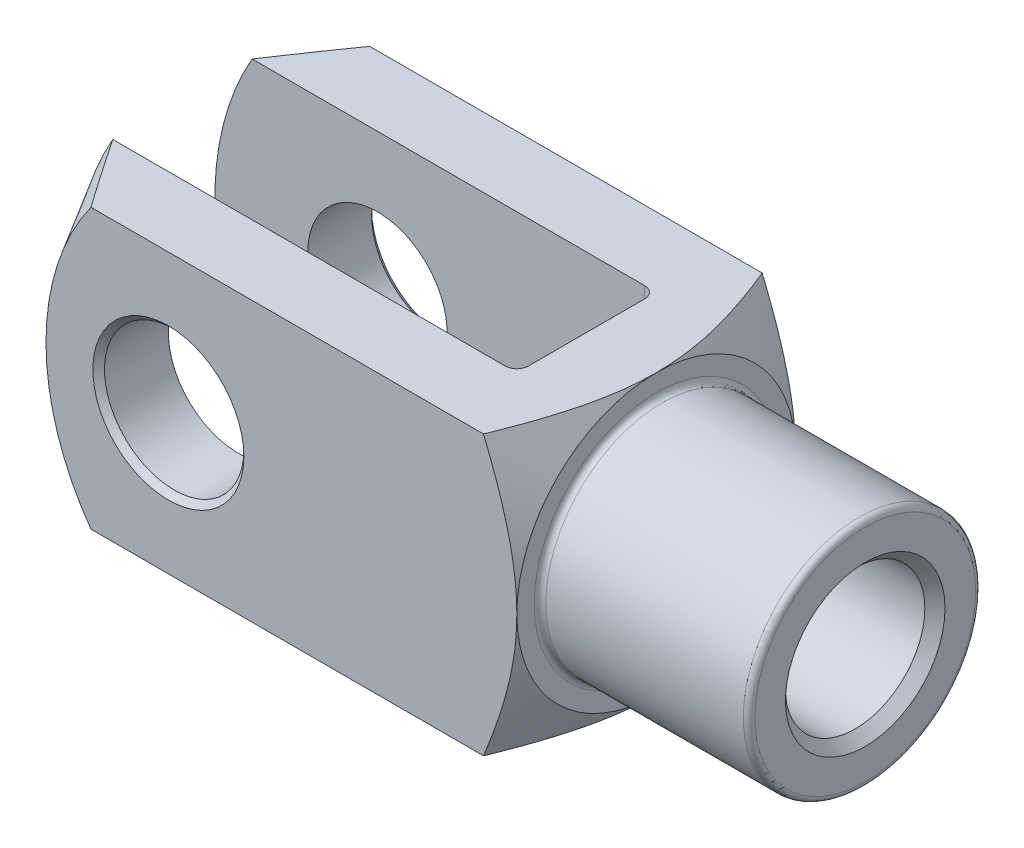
ISO-10303-21;
HEADER;
FILE_DESCRIPTION(('STEP AP214'),'2;1');
FILE_NAME('part.step','',(''),(''),'','','');
FILE_SCHEMA(('AUTOMOTIVE_DESIGN { 1 0 10303 214 1 1 1 1 }'));
ENDSEC;
DATA;
#1=APPLICATION_CONTEXT('core data for automotive mechanical design processes');
#2=APPLICATION_PROTOCOL_DEFINITION('international standard','automotive_design',2000,#1);
#3=PRODUCT_CONTEXT('',#1,'mechanical');
#4=PRODUCT('Part','Part','',(#3));
#5=PRODUCT_RELATED_PRODUCT_CATEGORY('part','',(#4));
#6=PRODUCT_DEFINITION_FORMATION('','',#4);
#7=PRODUCT_DEFINITION_CONTEXT('part definition',#1,'design');
#8=PRODUCT_DEFINITION('design','',#6,#7);
#9=PRODUCT_DEFINITION_SHAPE('','',#8);
#10=(LENGTH_UNIT() NAMED_UNIT(*) SI_UNIT(.MILLI.,.METRE.));
#11=(NAMED_UNIT(*) PLANE_ANGLE_UNIT() SI_UNIT($,.RADIAN.));
#12=(NAMED_UNIT(*) SI_UNIT($,.STERADIAN.) SOLID_ANGLE_UNIT());
#13=UNCERTAINTY_MEASURE_WITH_UNIT(LENGTH_MEASURE(1.E-05),#10,'distance_accuracy_value','');
#14=(GEOMETRIC_REPRESENTATION_CONTEXT(3) GLOBAL_UNCERTAINTY_ASSIGNED_CONTEXT((#13)) GLOBAL_UNIT_ASSIGNED_CONTEXT((#10,
#11,#12)) REPRESENTATION_CONTEXT('',''));
#15=CARTESIAN_POINT('',(0.,0.,0.));
#16=DIRECTION('',(0.,0.,1.));
#17=DIRECTION('',(1.,0.,0.));
#18=AXIS2_PLACEMENT_3D('',#15,#16,#17);
#19=CARTESIAN_POINT('',(-25.,-12.,-4.99999999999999));
#20=DIRECTION('',(0.,-1.,0.));
#21=DIRECTION('',(0.,0.,-1.));
#22=AXIS2_PLACEMENT_3D('',#19,#20,#21);
#23=CYLINDRICAL_SURFACE('',#22,1.);
#24=DIRECTION('',(0.,1.,0.));
#25=VECTOR('',#24,1.);
#26=CARTESIAN_POINT('',(-24.,-12.,-4.99999999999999));
#27=LINE('',#26,#25);
#28=CARTESIAN_POINT('',(-24.,-3.31662479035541,-4.99999999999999));
#29=VERTEX_POINT('',#28);
#30=CARTESIAN_POINT('',(-24.,-12.,-4.99999999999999));
#31=VERTEX_POINT('',#30);
#32=EDGE_CURVE('E359',#29,#31,#27,.F.);
#33=ORIENTED_EDGE('',*,*,#32,.F.);
#34=CARTESIAN_POINT('',(-24.,-3.31662479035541,-4.99999999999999));
#35=CARTESIAN_POINT('',(-24.000039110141,-3.2458892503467,-5.04693073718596));
#36=CARTESIAN_POINT('',(-24.0032998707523,-3.17421071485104,-5.0923055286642));
#37=CARTESIAN_POINT('',(-24.0152871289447,-3.02944292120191,-5.17972843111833));
#38=CARTESIAN_POINT('',(-24.0240049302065,-2.95635608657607,-5.22178171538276));
#39=CARTESIAN_POINT('',(-24.0458771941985,-2.80940810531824,-5.30228419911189));
#40=CARTESIAN_POINT('',(-24.0590080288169,-2.73555307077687,-5.34075122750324));
#41=CARTESIAN_POINT('',(-24.0890023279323,-2.58689159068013,-5.41432119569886));
#42=CARTESIAN_POINT('',(-24.1058679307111,-2.51208462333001,-5.44942219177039));
#43=CARTESIAN_POINT('',(-24.1575747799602,-2.30106419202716,-5.54321172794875));
#44=CARTESIAN_POINT('',(-24.1959404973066,-2.16400188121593,-5.59808248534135));
#45=CARTESIAN_POINT('',(-24.2800168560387,-1.88823561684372,-5.69702137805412));
#46=CARTESIAN_POINT('',(-24.3257315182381,-1.74953080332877,-5.74108356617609));
#47=CARTESIAN_POINT('',(-24.422565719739,-1.47057265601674,-5.81880111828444));
#48=CARTESIAN_POINT('',(-24.4737025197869,-1.33031573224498,-5.85242182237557));
#49=CARTESIAN_POINT('',(-24.579554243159,-1.04914006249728,-5.90930382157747));
#50=CARTESIAN_POINT('',(-24.634267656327,-0.908221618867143,-5.9325694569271));
#51=CARTESIAN_POINT('',(-24.7396434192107,-0.641756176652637,-5.96691885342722));
#52=CARTESIAN_POINT('',(-24.7900743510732,-0.51625291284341,-5.97907412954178));
#53=CARTESIAN_POINT('',(-24.891718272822,-0.265271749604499,-5.99544962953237));
#54=CARTESIAN_POINT('',(-24.9429298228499,-0.139794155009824,-5.99968301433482));
#55=CARTESIAN_POINT('',(-24.9960964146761,-0.00956179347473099,-5.99999428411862));
#56=CARTESIAN_POINT('',(-24.9980482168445,-0.00478087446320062,-5.99999999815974));
#57=CARTESIAN_POINT('',(-25.,0.,-6.));
#58=B_SPLINE_CURVE_WITH_KNOTS('',3,(#34,#35,#36,#37,#38,#39,#40,#41,#42,#43,#44,#45,#46,#47,#48,
#49,#50,#51,#52,#53,#54,#55,#56,#57),.UNSPECIFIED.,.F.,.F.,(4,2,2,2,2,2,2,2,2,2,2,4),(0.,
0.254478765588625,0.508553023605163,0.76128804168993,1.01416813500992,1.47107229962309,
1.92822730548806,2.38688397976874,2.8453482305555,3.25253093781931,3.65903657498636,
3.67452851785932),.UNSPECIFIED.);
#59=CARTESIAN_POINT('',(-25.,0.,-6.));
#60=VERTEX_POINT('',#59);
#61=EDGE_CURVE('E391',#29,#60,#58,.T.);
#62=ORIENTED_EDGE('',*,*,#61,.T.);
#63=DIRECTION('',(0.,1.,0.));
#64=VECTOR('',#63,1.);
#65=CARTESIAN_POINT('',(-25.,12.,-5.99999999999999));
#66=LINE('',#65,#64);
#67=CARTESIAN_POINT('',(-25.,-12.,-5.99999999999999));
#68=VERTEX_POINT('',#67);
#69=EDGE_CURVE('E183',#68,#60,#66,.T.);
#70=ORIENTED_EDGE('',*,*,#69,.F.);
#71=CARTESIAN_POINT('',(-25.,-12.,-4.99999999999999));
#72=DIRECTION('',(0.,-1.,0.));
#73=DIRECTION('',(0.,0.,-1.));
#74=AXIS2_PLACEMENT_3D('',#71,#72,#73);
#75=CIRCLE('',#74,1.);
#76=EDGE_CURVE('E198',#31,#68,#75,.F.);
#77=ORIENTED_EDGE('',*,*,#76,.F.);
#78=EDGE_LOOP('',(#33,#62,#70,#77));
#79=FACE_BOUND('',#78,.T.);
#80=ADVANCED_FACE('F37',(#79),#23,.F.);
#81=CARTESIAN_POINT('',(-24.,-12.,-5.99999999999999));
#82=DIRECTION('',(1.,0.,0.));
#83=DIRECTION('',(0.,0.,-1.));
#84=AXIS2_PLACEMENT_3D('',#81,#82,#83);
#85=PLANE('',#84);
#86=CARTESIAN_POINT('',(-24.,12.,-4.99999999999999));
#87=VERTEX_POINT('',#86);
#88=CARTESIAN_POINT('',(-24.,3.31662479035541,-4.99999999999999));
#89=VERTEX_POINT('',#88);
#90=EDGE_CURVE('E375',#87,#89,#27,.F.);
#91=ORIENTED_EDGE('',*,*,#90,.T.);
#92=CARTESIAN_POINT('',(-24.,0.,0.));
#93=DIRECTION('',(1.,0.,0.));
#94=DIRECTION('',(0.,0.,-1.));
#95=AXIS2_PLACEMENT_3D('',#92,#93,#94);
#96=CIRCLE('',#95,6.);
#97=CARTESIAN_POINT('',(-24.,3.31662479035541,5.));
#98=VERTEX_POINT('',#97);
#99=EDGE_CURVE('E428',#89,#98,#96,.T.);
#100=ORIENTED_EDGE('',*,*,#99,.T.);
#101=DIRECTION('',(0.,1.,0.));
#102=VECTOR('',#101,1.);
#103=CARTESIAN_POINT('',(-24.,12.,5.));
#104=LINE('',#103,#102);
#105=CARTESIAN_POINT('',(-24.,12.,5.));
#106=VERTEX_POINT('',#105);
#107=EDGE_CURVE('E160',#98,#106,#104,.T.);
#108=ORIENTED_EDGE('',*,*,#107,.T.);
#109=DIRECTION('',(0.,0.,-1.));
#110=VECTOR('',#109,1.);
#111=CARTESIAN_POINT('',(-24.,12.,-5.99999999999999));
#112=LINE('',#111,#110);
#113=EDGE_CURVE('E339',#106,#87,#112,.T.);
#114=ORIENTED_EDGE('',*,*,#113,.T.);
#115=EDGE_LOOP('',(#91,#100,#108,#114));
#116=FACE_BOUND('',#115,.T.);
#117=ADVANCED_FACE('F467',(#116),#85,.F.);
#118=CARTESIAN_POINT('',(-25.,-12.,5.));
#119=DIRECTION('',(0.,-1.,0.));
#120=DIRECTION('',(0.,0.,-1.));
#121=AXIS2_PLACEMENT_3D('',#118,#119,#120);
#122=CYLINDRICAL_SURFACE('',#121,1.);
#123=ORIENTED_EDGE('',*,*,#107,.F.);
#124=CARTESIAN_POINT('',(-24.,3.31662479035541,5.));
#125=CARTESIAN_POINT('',(-24.000039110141,3.2458892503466,5.04693073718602));
#126=CARTESIAN_POINT('',(-24.0032998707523,3.17421071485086,5.09230552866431));
#127=CARTESIAN_POINT('',(-24.0152871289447,3.02944292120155,5.17972843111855));
#128=CARTESIAN_POINT('',(-24.0240049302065,2.95635608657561,5.22178171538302));
#129=CARTESIAN_POINT('',(-24.0458771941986,2.80940810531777,5.30228419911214));
#130=CARTESIAN_POINT('',(-24.0590080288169,2.73555307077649,5.34075122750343));
#131=CARTESIAN_POINT('',(-24.0890023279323,2.58689159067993,5.41432119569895));
#132=CARTESIAN_POINT('',(-24.1058679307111,2.51208462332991,5.44942219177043));
#133=CARTESIAN_POINT('',(-24.1575747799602,2.30106419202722,5.54321172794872));
#134=CARTESIAN_POINT('',(-24.1959404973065,2.16400188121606,5.5980824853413));
#135=CARTESIAN_POINT('',(-24.2800168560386,1.88823561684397,5.69702137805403));
#136=CARTESIAN_POINT('',(-24.3257315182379,1.74953080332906,5.74108356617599));
#137=CARTESIAN_POINT('',(-24.422565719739,1.47057265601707,5.81880111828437));
#138=CARTESIAN_POINT('',(-24.473702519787,1.33031573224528,5.85242182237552));
#139=CARTESIAN_POINT('',(-24.5795542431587,1.04914006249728,5.90930382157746));
#140=CARTESIAN_POINT('',(-24.6342676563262,0.908221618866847,5.93256945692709));
#141=CARTESIAN_POINT('',(-24.7396434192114,0.641756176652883,5.96691885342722));
#142=CARTESIAN_POINT('',(-24.7900743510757,0.516252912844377,5.97907412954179));
#143=CARTESIAN_POINT('',(-24.8917182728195,0.265271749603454,5.99544962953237));
#144=CARTESIAN_POINT('',(-24.9429298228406,0.13979415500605,5.9996830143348));
#145=CARTESIAN_POINT('',(-24.9960964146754,0.00956179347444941,5.99999428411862));
#146=CARTESIAN_POINT('',(-24.9980482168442,0.00478087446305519,5.99999999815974));
#147=CARTESIAN_POINT('',(-25.,0.,6.));
#148=B_SPLINE_CURVE_WITH_KNOTS('',3,(#124,#125,#126,#127,#128,#129,#130,#131,#132,#133,#134,
#135,#136,#137,#138,#139,#140,#141,#142,#143,#144,#145,#146,#147),.UNSPECIFIED.,.F.,.F.,(4,2,2,
2,2,2,2,2,2,2,2,4),(0.,0.254478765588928,0.508553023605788,0.76128804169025,1.01416813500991,
1.47107229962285,1.92822730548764,2.38688397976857,2.84534823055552,3.25253093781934,
3.65903657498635,3.67452851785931),.UNSPECIFIED.);
#149=CARTESIAN_POINT('',(-25.,0.,6.));
#150=VERTEX_POINT('',#149);
#151=EDGE_CURVE('E145',#98,#150,#148,.T.);
#152=ORIENTED_EDGE('',*,*,#151,.T.);
#153=DIRECTION('',(0.,1.,0.));
#154=VECTOR('',#153,1.);
#155=CARTESIAN_POINT('',(-25.,-12.,6.));
#156=LINE('',#155,#154);
#157=CARTESIAN_POINT('',(-25.,12.,6.));
#158=VERTEX_POINT('',#157);
#159=EDGE_CURVE('E159',#158,#150,#156,.F.);
#160=ORIENTED_EDGE('',*,*,#159,.F.);
#161=CARTESIAN_POINT('',(-25.,12.,5.));
#162=DIRECTION('',(0.,1.,0.));
#163=DIRECTION('',(0.,0.,1.));
#164=AXIS2_PLACEMENT_3D('',#161,#162,#163);
#165=CIRCLE('',#164,1.);
#166=EDGE_CURVE('E190',#106,#158,#165,.F.);
#167=ORIENTED_EDGE('',*,*,#166,.F.);
#168=EDGE_LOOP('',(#123,#152,#160,#167));
#169=FACE_BOUND('',#168,.T.);
#170=ADVANCED_FACE('F156',(#169),#122,.F.);
#171=CARTESIAN_POINT('',(-62.,-12.,-5.99999999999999));
#172=DIRECTION('',(0.,0.,-1.));
#173=DIRECTION('',(-1.,0.,0.));
#174=AXIS2_PLACEMENT_3D('',#171,#172,#173);
#175=PLANE('',#174);
#176=CARTESIAN_POINT('',(-48.,0.,-5.99999999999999));
#177=DIRECTION('',(0.,0.,-1.));
#178=DIRECTION('',(-1.,0.,0.));
#179=AXIS2_PLACEMENT_3D('',#176,#177,#178);
#180=CIRCLE('',#179,6.);
#181=CARTESIAN_POINT('',(-54.,0.,-5.99999999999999));
#182=VERTEX_POINT('',#181);
#183=EDGE_CURVE('E369',#182,#182,#180,.F.);
#184=ORIENTED_EDGE('',*,*,#183,.F.);
#185=EDGE_LOOP('',(#184));
#186=FACE_BOUND('',#185,.T.);
#187=CARTESIAN_POINT('',(-38.,0.,-5.99999999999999));
#188=DIRECTION('',(0.,0.,1.));
#189=DIRECTION('',(1.,0.,0.));
#190=AXIS2_PLACEMENT_3D('',#187,#188,#189);
#191=CIRCLE('',#190,24.);
#192=CARTESIAN_POINT('',(-58.7846096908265,12.,-5.99999999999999));
#193=VERTEX_POINT('',#192);
#194=CARTESIAN_POINT('',(-58.7846096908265,-12.,-5.99999999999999));
#195=VERTEX_POINT('',#194);
#196=EDGE_CURVE('E277',#193,#195,#191,.T.);
#197=ORIENTED_EDGE('',*,*,#196,.T.);
#198=DIRECTION('',(-1.,0.,0.));
#199=VECTOR('',#198,1.);
#200=CARTESIAN_POINT('',(-62.,-12.,-5.99999999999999));
#201=LINE('',#200,#199);
#202=EDGE_CURVE('E334',#68,#195,#201,.T.);
#203=ORIENTED_EDGE('',*,*,#202,.F.);
#204=ORIENTED_EDGE('',*,*,#69,.T.);
#205=CARTESIAN_POINT('',(-25.,12.,-5.99999999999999));
#206=VERTEX_POINT('',#205);
#207=EDGE_CURVE('E179',#60,#206,#66,.T.);
#208=ORIENTED_EDGE('',*,*,#207,.T.);
#209=DIRECTION('',(-1.,0.,0.));
#210=VECTOR('',#209,1.);
#211=CARTESIAN_POINT('',(-62.,12.,-5.99999999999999));
#212=LINE('',#211,#210);
#213=EDGE_CURVE('E347',#206,#193,#212,.T.);
#214=ORIENTED_EDGE('',*,*,#213,.T.);
#215=EDGE_LOOP('',(#197,#203,#204,#208,#214));
#216=FACE_BOUND('',#215,.T.);
#217=ADVANCED_FACE('F394',(#186,#216),#175,.F.);
#218=CARTESIAN_POINT('',(-62.,-12.,6.00000000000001));
#219=DIRECTION('',(0.,0.,1.));
#220=DIRECTION('',(1.,0.,0.));
#221=AXIS2_PLACEMENT_3D('',#218,#219,#220);
#222=PLANE('',#221);
#223=CARTESIAN_POINT('',(-48.,0.,6.00000000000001));
#224=DIRECTION('',(0.,0.,1.));
#225=DIRECTION('',(1.,0.,0.));
#226=AXIS2_PLACEMENT_3D('',#223,#224,#225);
#227=CIRCLE('',#226,6.);
#228=CARTESIAN_POINT('',(-42.,0.,6.));
#229=VERTEX_POINT('',#228);
#230=EDGE_CURVE('E346',#229,#229,#227,.F.);
#231=ORIENTED_EDGE('',*,*,#230,.F.);
#232=EDGE_LOOP('',(#231));
#233=FACE_BOUND('',#232,.T.);
#234=DIRECTION('',(1.,0.,0.));
#235=VECTOR('',#234,1.);
#236=CARTESIAN_POINT('',(-62.,-12.,6.00000000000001));
#237=LINE('',#236,#235);
#238=CARTESIAN_POINT('',(-58.7846096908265,-12.,6.00000000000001));
#239=VERTEX_POINT('',#238);
#240=CARTESIAN_POINT('',(-25.,-12.,6.));
#241=VERTEX_POINT('',#240);
#242=EDGE_CURVE('E338',#239,#241,#237,.T.);
#243=ORIENTED_EDGE('',*,*,#242,.F.);
#244=CARTESIAN_POINT('',(-38.,0.,6.00000000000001));
#245=DIRECTION('',(0.,0.,1.));
#246=DIRECTION('',(1.,0.,0.));
#247=AXIS2_PLACEMENT_3D('',#244,#245,#246);
#248=CIRCLE('',#247,24.);
#249=CARTESIAN_POINT('',(-58.7846096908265,12.,6.00000000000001));
#250=VERTEX_POINT('',#249);
#251=EDGE_CURVE('E420',#250,#239,#248,.T.);
#252=ORIENTED_EDGE('',*,*,#251,.F.);
#253=DIRECTION('',(1.,0.,0.));
#254=VECTOR('',#253,1.);
#255=CARTESIAN_POINT('',(-62.,12.,6.00000000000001));
#256=LINE('',#255,#254);
#257=EDGE_CURVE('E176',#250,#158,#256,.T.);
#258=ORIENTED_EDGE('',*,*,#257,.T.);
#259=ORIENTED_EDGE('',*,*,#159,.T.);
#260=EDGE_CURVE('E164',#150,#241,#156,.F.);
#261=ORIENTED_EDGE('',*,*,#260,.T.);
#262=EDGE_LOOP('',(#243,#252,#258,#259,#261));
#263=FACE_BOUND('',#262,.T.);
#264=ADVANCED_FACE('F173',(#233,#263),#222,.F.);
#265=CARTESIAN_POINT('',(-62.,-12.,12.));
#266=DIRECTION('',(0.,0.,1.));
#267=DIRECTION('',(1.,0.,0.));
#268=AXIS2_PLACEMENT_3D('',#265,#266,#267);
#269=PLANE('',#268);
#270=CARTESIAN_POINT('',(-48.,0.,12.));
#271=DIRECTION('',(0.,0.,1.));
#272=DIRECTION('',(1.,0.,0.));
#273=AXIS2_PLACEMENT_3D('',#270,#271,#272);
#274=CIRCLE('',#273,6.50000000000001);
#275=CARTESIAN_POINT('',(-41.5,0.,12.));
#276=VERTEX_POINT('',#275);
#277=EDGE_CURVE('E229',#276,#276,#274,.F.);
#278=ORIENTED_EDGE('',*,*,#277,.T.);
#279=EDGE_LOOP('',(#278));
#280=FACE_BOUND('',#279,.T.);
#281=DIRECTION('',(1.,0.,0.));
#282=VECTOR('',#281,1.);
#283=CARTESIAN_POINT('',(-62.,12.,12.));
#284=LINE('',#283,#282);
#285=CARTESIAN_POINT('',(-54.6650269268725,12.,12.));
#286=VERTEX_POINT('',#285);
#287=CARTESIAN_POINT('',(-20.8697557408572,12.,12.));
#288=VERTEX_POINT('',#287);
#289=EDGE_CURVE('E366',#286,#288,#284,.T.);
#290=ORIENTED_EDGE('',*,*,#289,.F.);
#291=CARTESIAN_POINT('',(-38.,0.,12.));
#292=DIRECTION('',(0.,0.,1.));
#293=DIRECTION('',(1.,0.,0.));
#294=AXIS2_PLACEMENT_3D('',#291,#292,#293);
#295=CIRCLE('',#294,20.5358983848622);
#296=CARTESIAN_POINT('',(-54.6650269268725,-12.,12.));
#297=VERTEX_POINT('',#296);
#298=EDGE_CURVE('E61',#286,#297,#295,.T.);
#299=ORIENTED_EDGE('',*,*,#298,.T.);
#300=DIRECTION('',(1.,0.,0.));
#301=VECTOR('',#300,1.);
#302=CARTESIAN_POINT('',(-62.,-12.,12.));
#303=LINE('',#302,#301);
#304=CARTESIAN_POINT('',(-20.8697557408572,-12.,12.));
#305=VERTEX_POINT('',#304);
#306=EDGE_CURVE('E363',#297,#305,#303,.T.);
#307=ORIENTED_EDGE('',*,*,#306,.T.);
#308=CARTESIAN_POINT('',(-26.8270481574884,-24.508852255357,12.));
#309=CARTESIAN_POINT('',(-26.5204158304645,-23.9174203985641,12.));
#310=CARTESIAN_POINT('',(-26.2154046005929,-23.3251403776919,12.));
#311=CARTESIAN_POINT('',(-25.6094839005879,-22.1384473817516,12.));
#312=CARTESIAN_POINT('',(-25.3085746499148,-21.5440342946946,12.));
#313=CARTESIAN_POINT('',(-24.7112306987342,-20.3516642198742,12.));
#314=CARTESIAN_POINT('',(-24.4148047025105,-19.753702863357,12.));
#315=CARTESIAN_POINT('',(-23.8281918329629,-18.5547362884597,12.));
#316=CARTESIAN_POINT('',(-23.5380048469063,-17.9537311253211,12.));
#317=CARTESIAN_POINT('',(-22.9478447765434,-16.7109015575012,12.));
#318=CARTESIAN_POINT('',(-22.6483679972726,-16.0688406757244,12.));
#319=CARTESIAN_POINT('',(-22.0608191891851,-14.7794664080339,12.));
#320=CARTESIAN_POINT('',(-21.7727477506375,-14.132152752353,12.));
#321=CARTESIAN_POINT('',(-21.211729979,-12.8312921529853,12.));
#322=CARTESIAN_POINT('',(-20.9387769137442,-12.177748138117,12.));
#323=CARTESIAN_POINT('',(-20.5444276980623,-11.1914316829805,12.));
#324=CARTESIAN_POINT('',(-20.4154954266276,-10.8616706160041,12.));
#325=CARTESIAN_POINT('',(-20.1634870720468,-10.1999223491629,12.));
#326=CARTESIAN_POINT('',(-20.0404108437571,-9.867935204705,12.));
#327=CARTESIAN_POINT('',(-19.7750973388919,-9.12924658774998,12.));
#328=CARTESIAN_POINT('',(-19.6344928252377,-8.72195527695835,12.));
#329=CARTESIAN_POINT('',(-19.3653837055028,-7.90341175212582,12.));
#330=CARTESIAN_POINT('',(-19.2368780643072,-7.4921598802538,12.));
#331=CARTESIAN_POINT('',(-18.99435151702,-6.66538582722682,12.));
#332=CARTESIAN_POINT('',(-18.8803303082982,-6.24986373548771,12.));
#333=CARTESIAN_POINT('',(-18.6694959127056,-5.41444148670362,12.));
#334=CARTESIAN_POINT('',(-18.5726825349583,-4.99454137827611,12.));
#335=CARTESIAN_POINT('',(-18.4012191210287,-4.16046851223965,12.));
#336=CARTESIAN_POINT('',(-18.3261021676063,-3.74639268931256,12.));
#337=CARTESIAN_POINT('',(-18.1977094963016,-2.91483992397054,12.));
#338=CARTESIAN_POINT('',(-18.1444330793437,-2.49736309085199,12.));
#339=CARTESIAN_POINT('',(-18.061948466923,-1.66028284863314,12.));
#340=CARTESIAN_POINT('',(-18.032724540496,-1.24068101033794,12.));
#341=CARTESIAN_POINT('',(-17.9996341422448,-0.400474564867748,12.));
#342=CARTESIAN_POINT('',(-17.9957667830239,0.0201300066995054,12.));
#343=CARTESIAN_POINT('',(-18.0129154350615,0.830148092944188,12.));
#344=CARTESIAN_POINT('',(-18.0321388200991,1.2196011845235,12.));
#345=CARTESIAN_POINT('',(-18.091746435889,1.99686728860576,12.));
#346=CARTESIAN_POINT('',(-18.1321306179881,2.38468030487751,12.));
#347=CARTESIAN_POINT('',(-18.232579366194,3.15792367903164,12.));
#348=CARTESIAN_POINT('',(-18.2926540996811,3.54335270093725,12.));
#349=CARTESIAN_POINT('',(-18.4305032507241,4.31101186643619,12.));
#350=CARTESIAN_POINT('',(-18.5082781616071,4.69324192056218,12.));
#351=CARTESIAN_POINT('',(-18.6818401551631,5.46519444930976,12.));
#352=CARTESIAN_POINT('',(-18.7780834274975,5.85481356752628,12.));
#353=CARTESIAN_POINT('',(-18.9846981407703,6.63026168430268,12.));
#354=CARTESIAN_POINT('',(-19.0950697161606,7.01609064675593,12.));
#355=CARTESIAN_POINT('',(-19.327805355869,7.78407900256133,12.));
#356=CARTESIAN_POINT('',(-19.450168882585,8.16623855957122,12.));
#357=CARTESIAN_POINT('',(-19.6413066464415,8.73690278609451,12.));
#358=CARTESIAN_POINT('',(-19.706283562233,8.92669203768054,12.));
#359=CARTESIAN_POINT('',(-19.8385670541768,9.30545658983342,12.));
#360=CARTESIAN_POINT('',(-19.9058736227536,9.49443189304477,12.));
#361=CARTESIAN_POINT('',(-20.1221378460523,10.09093133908,12.));
#362=CARTESIAN_POINT('',(-20.2750221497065,10.4970351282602,12.));
#363=CARTESIAN_POINT('',(-20.5890916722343,11.3060297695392,12.));
#364=CARTESIAN_POINT('',(-20.750277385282,11.7089204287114,12.));
#365=CARTESIAN_POINT('',(-21.0796092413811,12.5119467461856,12.));
#366=CARTESIAN_POINT('',(-21.2477569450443,12.9120817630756,12.));
#367=CARTESIAN_POINT('',(-21.5898549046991,13.7098486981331,12.));
#368=CARTESIAN_POINT('',(-21.7638050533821,14.1074806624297,12.));
#369=CARTESIAN_POINT('',(-22.1167497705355,14.900905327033,12.));
#370=CARTESIAN_POINT('',(-22.2957485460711,15.296696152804,12.));
#371=CARTESIAN_POINT('',(-22.6579079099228,16.0863711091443,12.));
#372=CARTESIAN_POINT('',(-22.841068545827,16.4802552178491,12.));
#373=CARTESIAN_POINT('',(-23.3958010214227,17.6593177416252,12.));
#374=CARTESIAN_POINT('',(-23.7726679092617,18.4420054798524,12.));
#375=CARTESIAN_POINT('',(-24.5379796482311,20.004634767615,12.));
#376=CARTESIAN_POINT('',(-24.9264562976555,20.7845606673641,12.));
#377=CARTESIAN_POINT('',(-25.7113669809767,22.3404133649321,12.));
#378=CARTESIAN_POINT('',(-26.107801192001,23.1163400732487,12.));
#379=CARTESIAN_POINT('',(-26.9066094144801,24.6646398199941,12.));
#380=CARTESIAN_POINT('',(-27.3089803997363,25.4370144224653,12.));
#381=CARTESIAN_POINT('',(-28.1185505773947,26.9792185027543,12.));
#382=CARTESIAN_POINT('',(-28.5257497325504,27.7490480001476,12.));
#383=CARTESIAN_POINT('',(-29.6315922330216,29.8271201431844,12.));
#384=CARTESIAN_POINT('',(-30.3338843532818,31.1334202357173,12.));
#385=CARTESIAN_POINT('',(-31.7463886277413,33.7419610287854,12.));
#386=CARTESIAN_POINT('',(-32.4566018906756,35.0442011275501,12.));
#387=CARTESIAN_POINT('',(-33.8786764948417,37.6380871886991,12.));
#388=CARTESIAN_POINT('',(-34.5905050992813,38.9297511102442,12.));
#389=CARTESIAN_POINT('',(-35.6613936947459,40.865371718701,12.));
#390=CARTESIAN_POINT('',(-36.0188525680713,41.5102153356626,12.));
#391=CARTESIAN_POINT('',(-36.7347123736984,42.7993785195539,12.));
#392=CARTESIAN_POINT('',(-37.0931133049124,43.4436980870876,12.));
#393=CARTESIAN_POINT('',(-37.4519232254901,44.0877898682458,12.));
#394=B_SPLINE_CURVE_WITH_KNOTS('',3,(#308,#309,#310,#311,#312,#313,#314,#315,#316,#317,#318,
#319,#320,#321,#322,#323,#324,#325,#326,#327,#328,#329,#330,#331,#332,#333,#334,#335,#336,#337,
#338,#339,#340,#341,#342,#343,#344,#345,#346,#347,#348,#349,#350,#351,#352,#353,#354,#355,#356,
#357,#358,#359,#360,#361,#362,#363,#364,#365,#366,#367,#368,#369,#370,#371,#372,#373,#374,#375,
#376,#377,#378,#379,#380,#381,#382,#383,#384,#385,#386,#387,#388,#389,#390,#391,#392,#393),
.UNSPECIFIED.,.F.,.F.,(4,2,2,2,2,2,2,2,2,2,2,2,2,2,2,2,2,2,2,2,2,2,2,2,2,2,2,2,2,2,2,2,2,2,2,2,
2,2,2,2,2,2,4),(0.,1.99859095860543,3.99728842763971,5.99946635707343,8.00160807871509,
10.1269271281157,12.2523560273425,14.3768307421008,15.4389968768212,16.501136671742,
17.793611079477,19.0859748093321,20.3783115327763,21.6706339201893,22.9326201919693,
24.194566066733,25.4556859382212,26.7167616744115,27.8859474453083,29.0551305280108,
30.2249182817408,31.3947386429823,32.5984184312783,33.8021096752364,35.0057469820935,
35.6075466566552,36.209344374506,37.51100701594,38.8127472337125,40.1147808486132,
41.4167903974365,42.719918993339,44.0230624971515,46.6290236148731,49.2429304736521,
51.8568955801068,54.469571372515,57.082227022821,61.5315331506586,65.9814700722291,
70.4059202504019,72.6177970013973,74.829671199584),.UNSPECIFIED.);
#395=CARTESIAN_POINT('',(-18.,0.,12.));
#396=VERTEX_POINT('',#395);
#397=EDGE_CURVE('E306',#396,#305,#394,.F.);
#398=ORIENTED_EDGE('',*,*,#397,.F.);
#399=EDGE_CURVE('E304',#288,#396,#394,.F.);
#400=ORIENTED_EDGE('',*,*,#399,.F.);
#401=EDGE_LOOP('',(#290,#299,#307,#398,#400));
#402=FACE_BOUND('',#401,.T.);
#403=ADVANCED_FACE('F288',(#280,#402),#269,.T.);
#404=CARTESIAN_POINT('',(-62.,-12.,12.));
#405=DIRECTION('',(0.,-1.,0.));
#406=DIRECTION('',(0.,0.,-1.));
#407=AXIS2_PLACEMENT_3D('',#404,#405,#406);
#408=PLANE('',#407);
#409=ORIENTED_EDGE('',*,*,#202,.T.);
#410=CARTESIAN_POINT('',(-68.2786029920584,-12.,8.84338025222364));
#411=CARTESIAN_POINT('',(-67.6947368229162,-12.,7.90330325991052));
#412=CARTESIAN_POINT('',(-67.1092717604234,-12.,6.96421474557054));
#413=CARTESIAN_POINT('',(-65.9343954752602,-12.,5.08848378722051));
#414=CARTESIAN_POINT('',(-65.3449841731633,-12.,4.15184139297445));
#415=CARTESIAN_POINT('',(-64.1607841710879,-12.,2.28039346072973));
#416=CARTESIAN_POINT('',(-63.565989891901,-12.,1.34559145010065));
#417=CARTESIAN_POINT('',(-62.3707199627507,-12.,-0.520365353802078));
#418=CARTESIAN_POINT('',(-61.7702443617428,-12.,-1.45152017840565));
#419=CARTESIAN_POINT('',(-60.5371594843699,-12.,-3.34796497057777));
#420=CARTESIAN_POINT('',(-59.9042532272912,-12.,-4.31306203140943));
#421=CARTESIAN_POINT('',(-58.6288928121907,-12.,-6.23692872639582));
#422=CARTESIAN_POINT('',(-57.9864387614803,-12.,-7.19569843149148));
#423=CARTESIAN_POINT('',(-57.0137395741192,-12.,-8.62721356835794));
#424=CARTESIAN_POINT('',(-56.6881242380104,-12.,-9.10310585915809));
#425=CARTESIAN_POINT('',(-56.0333476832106,-12.,-10.0524433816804));
#426=CARTESIAN_POINT('',(-55.7041864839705,-12.,-10.5258886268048));
#427=CARTESIAN_POINT('',(-55.0417887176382,-12.,-11.4698924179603));
#428=CARTESIAN_POINT('',(-54.7085523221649,-12.,-11.9404510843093));
#429=CARTESIAN_POINT('',(-54.0373266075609,-12.,-12.8781628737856));
#430=CARTESIAN_POINT('',(-53.6993373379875,-12.,-13.3453160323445));
#431=CARTESIAN_POINT('',(-53.0209560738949,-12.,-14.2712057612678));
#432=CARTESIAN_POINT('',(-52.6806158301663,-12.,-14.7299801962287));
#433=CARTESIAN_POINT('',(-51.9934550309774,-12.,-15.6426726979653));
#434=CARTESIAN_POINT('',(-51.6466343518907,-12.,-16.0965906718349));
#435=CARTESIAN_POINT('',(-50.944777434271,-12.,-16.999043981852));
#436=CARTESIAN_POINT('',(-50.5897305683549,-12.,-17.4475710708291));
#437=CARTESIAN_POINT('',(-49.8702804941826,-12.,-18.337043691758));
#438=CARTESIAN_POINT('',(-49.5058777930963,-12.,-18.7779896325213));
#439=CARTESIAN_POINT('',(-48.7694365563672,-12.,-19.645646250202));
#440=CARTESIAN_POINT('',(-48.3975164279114,-12.,-20.0724571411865));
#441=CARTESIAN_POINT('',(-47.639653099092,-12.,-20.9137472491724));
#442=CARTESIAN_POINT('',(-47.2537063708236,-12.,-21.3282233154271));
#443=CARTESIAN_POINT('',(-46.6621255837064,-12.,-21.9367708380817));
#444=CARTESIAN_POINT('',(-46.4630426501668,-12.,-22.1372171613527));
#445=CARTESIAN_POINT('',(-46.0599745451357,-12.,-22.533109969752));
#446=CARTESIAN_POINT('',(-45.8559896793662,-12.,-22.7285567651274));
#447=CARTESIAN_POINT('',(-45.4425971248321,-12.,-23.1134290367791));
#448=CARTESIAN_POINT('',(-45.2331922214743,-12.,-23.3028574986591));
#449=CARTESIAN_POINT('',(-44.8081788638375,-12.,-23.6745980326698));
#450=CARTESIAN_POINT('',(-44.5925713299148,-12.,-23.856911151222));
#451=CARTESIAN_POINT('',(-44.2600203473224,-12.,-24.1270885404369));
#452=CARTESIAN_POINT('',(-44.145633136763,-12.,-24.2181054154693));
#453=CARTESIAN_POINT('',(-43.9148670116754,-12.,-24.3975755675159));
#454=CARTESIAN_POINT('',(-43.7984881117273,-12.,-24.4860288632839));
#455=CARTESIAN_POINT('',(-43.4461413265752,-12.,-24.7471697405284));
#456=CARTESIAN_POINT('',(-43.2069947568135,-12.,-24.9156125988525));
#457=CARTESIAN_POINT('',(-42.7195001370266,-12.,-25.2383188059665));
#458=CARTESIAN_POINT('',(-42.4711595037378,-12.,-25.3925932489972));
#459=CARTESIAN_POINT('',(-41.9645146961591,-12.,-25.6835963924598));
#460=CARTESIAN_POINT('',(-41.7062131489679,-12.,-25.8203296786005));
#461=CARTESIAN_POINT('',(-41.0356348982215,-12.,-26.1405466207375));
#462=CARTESIAN_POINT('',(-40.6158504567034,-12.,-26.3091476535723));
#463=CARTESIAN_POINT('',(-39.9703142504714,-12.,-26.5095003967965));
#464=CARTESIAN_POINT('',(-39.7525810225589,-12.,-26.5675140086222));
#465=CARTESIAN_POINT('',(-39.3127569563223,-12.,-26.6640173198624));
#466=CARTESIAN_POINT('',(-39.0906663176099,-12.,-26.7025079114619));
#467=CARTESIAN_POINT('',(-38.6415790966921,-12.,-26.7585747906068));
#468=CARTESIAN_POINT('',(-38.4145556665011,-12.,-26.7759381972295));
#469=CARTESIAN_POINT('',(-37.9599023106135,-12.,-26.7882217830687));
#470=CARTESIAN_POINT('',(-37.7322724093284,-12.,-26.7831428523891));
#471=CARTESIAN_POINT('',(-37.2785688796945,-12.,-26.7507852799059));
#472=CARTESIAN_POINT('',(-37.0524955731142,-12.,-26.7235021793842));
#473=CARTESIAN_POINT('',(-36.6038899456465,-12.,-26.6479928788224));
#474=CARTESIAN_POINT('',(-36.3813581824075,-12.,-26.5997634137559));
#475=CARTESIAN_POINT('',(-35.9005519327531,-12.,-26.4736338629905));
#476=CARTESIAN_POINT('',(-35.64328906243,-12.,-26.3918933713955));
#477=CARTESIAN_POINT('',(-35.137130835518,-12.,-26.2055998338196));
#478=CARTESIAN_POINT('',(-34.8882402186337,-12.,-26.1010341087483));
#479=CARTESIAN_POINT('',(-34.3986617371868,-12.,-25.8726383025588));
#480=CARTESIAN_POINT('',(-34.1579999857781,-12.,-25.7487527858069));
#481=CARTESIAN_POINT('',(-33.6854799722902,-12.,-25.485398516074));
#482=CARTESIAN_POINT('',(-33.4536207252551,-12.,-25.3459315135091));
#483=CARTESIAN_POINT('',(-32.9233788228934,-12.,-25.0064399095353));
#484=CARTESIAN_POINT('',(-32.6281184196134,-12.,-24.8015559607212));
#485=CARTESIAN_POINT('',(-32.0502738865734,-12.,-24.3745460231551));
#486=CARTESIAN_POINT('',(-31.7676958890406,-12.,-24.1524118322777));
#487=CARTESIAN_POINT('',(-31.2130794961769,-12.,-23.6943719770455));
#488=CARTESIAN_POINT('',(-30.9410624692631,-12.,-23.4584405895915));
#489=CARTESIAN_POINT('',(-30.4066261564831,-12.,-22.9760898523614));
#490=CARTESIAN_POINT('',(-30.1442052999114,-12.,-22.7296722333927));
#491=CARTESIAN_POINT('',(-29.625830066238,-12.,-22.2267453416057));
#492=CARTESIAN_POINT('',(-29.3699307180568,-12.,-21.9701795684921));
#493=CARTESIAN_POINT('',(-28.8652654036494,-12.,-21.4501311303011));
#494=CARTESIAN_POINT('',(-28.6164996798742,-12.,-21.1866482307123));
#495=CARTESIAN_POINT('',(-28.1253910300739,-12.,-20.6542828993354));
#496=CARTESIAN_POINT('',(-27.8830417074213,-12.,-20.3854063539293));
#497=CARTESIAN_POINT('',(-27.4036952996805,-12.,-19.842944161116));
#498=CARTESIAN_POINT('',(-27.1666981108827,-12.,-19.5693586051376));
#499=CARTESIAN_POINT('',(-26.6001496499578,-12.,-18.9040671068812));
#500=CARTESIAN_POINT('',(-26.2729278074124,-12.,-18.5103784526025));
#501=CARTESIAN_POINT('',(-25.6261860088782,-12.,-17.716617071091));
#502=CARTESIAN_POINT('',(-25.306667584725,-12.,-17.3165430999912));
#503=CARTESIAN_POINT('',(-24.6790054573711,-12.,-16.5174455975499));
#504=CARTESIAN_POINT('',(-24.3707624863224,-12.,-16.118499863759));
#505=CARTESIAN_POINT('',(-23.7597996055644,-12.,-15.316589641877));
#506=CARTESIAN_POINT('',(-23.457078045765,-12.,-14.9136264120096));
#507=CARTESIAN_POINT('',(-23.1566197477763,-12.,-14.5090044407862));
#508=B_SPLINE_CURVE_WITH_KNOTS('',3,(#410,#411,#412,#413,#414,#415,#416,#417,#418,#419,#420,
#421,#422,#423,#424,#425,#426,#427,#428,#429,#430,#431,#432,#433,#434,#435,#436,#437,#438,#439,
#440,#441,#442,#443,#444,#445,#446,#447,#448,#449,#450,#451,#452,#453,#454,#455,#456,#457,#458,
#459,#460,#461,#462,#463,#464,#465,#466,#467,#468,#469,#470,#471,#472,#473,#474,#475,#476,#477,
#478,#479,#480,#481,#482,#483,#484,#485,#486,#487,#488,#489,#490,#491,#492,#493,#494,#495,#496,
#497,#498,#499,#500,#501,#502,#503,#504,#505,#506,#507),.UNSPECIFIED.,.F.,.F.,(4,2,2,2,2,2,2,2,
2,2,2,2,2,2,2,2,2,2,2,2,2,2,2,2,2,2,2,2,2,2,2,2,2,2,2,2,2,2,2,2,2,2,2,2,2,2,2,2,4),(0.,
3.31991386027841,6.6398947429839,9.96383874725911,13.287754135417,16.7500600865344,
20.2123271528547,21.9421957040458,23.6720547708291,25.4018412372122,27.1316096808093,
28.8452569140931,30.5589368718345,32.2749700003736,33.9909103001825,35.6890521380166,
37.3876240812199,38.2350900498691,39.082503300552,39.9294893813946,40.7763504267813,
41.2148575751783,41.6533615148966,42.5304910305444,43.4069277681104,44.2831349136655,
45.6347123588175,46.3099700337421,46.9851968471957,47.6671724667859,48.3491210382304,
49.0312065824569,49.7133984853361,50.5219110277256,51.3308738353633,52.1422020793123,
52.9534392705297,54.0307393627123,55.1085548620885,56.188448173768,57.2681639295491,
58.3551054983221,59.4420839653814,60.5279345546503,61.6137640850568,63.1494038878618,
64.6853465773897,66.1977597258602,67.7097132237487),.UNSPECIFIED.);
#509=CARTESIAN_POINT('',(-54.6650269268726,-12.,-12.));
#510=VERTEX_POINT('',#509);
#511=EDGE_CURVE('E276',#195,#510,#508,.T.);
#512=ORIENTED_EDGE('',*,*,#511,.T.);
#513=DIRECTION('',(1.,0.,0.));
#514=VECTOR('',#513,1.);
#515=CARTESIAN_POINT('',(-62.,-12.,-12.));
#516=LINE('',#515,#514);
#517=CARTESIAN_POINT('',(-20.8697557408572,-12.,-12.));
#518=VERTEX_POINT('',#517);
#519=EDGE_CURVE('E360',#510,#518,#516,.T.);
#520=ORIENTED_EDGE('',*,*,#519,.T.);
#521=CARTESIAN_POINT('',(-26.8270481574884,-12.,-24.508852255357));
#522=CARTESIAN_POINT('',(-26.5204158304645,-12.,-23.9174203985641));
#523=CARTESIAN_POINT('',(-26.2154046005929,-12.,-23.3251403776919));
#524=CARTESIAN_POINT('',(-25.6094839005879,-12.,-22.1384473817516));
#525=CARTESIAN_POINT('',(-25.3085746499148,-12.,-21.5440342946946));
#526=CARTESIAN_POINT('',(-24.7112306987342,-12.,-20.3516642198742));
#527=CARTESIAN_POINT('',(-24.4148047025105,-12.,-19.753702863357));
#528=CARTESIAN_POINT('',(-23.8281918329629,-12.,-18.5547362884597));
#529=CARTESIAN_POINT('',(-23.5380048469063,-12.,-17.9537311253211));
#530=CARTESIAN_POINT('',(-22.9478447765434,-12.,-16.7109015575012));
#531=CARTESIAN_POINT('',(-22.6483679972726,-12.,-16.0688406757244));
#532=CARTESIAN_POINT('',(-22.0608191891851,-12.,-14.7794664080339));
#533=CARTESIAN_POINT('',(-21.7727477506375,-12.,-14.132152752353));
#534=CARTESIAN_POINT('',(-21.211729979,-12.,-12.8312921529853));
#535=CARTESIAN_POINT('',(-20.9387769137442,-12.,-12.177748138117));
#536=CARTESIAN_POINT('',(-20.5444276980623,-12.,-11.1914316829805));
#537=CARTESIAN_POINT('',(-20.4154954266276,-12.,-10.8616706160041));
#538=CARTESIAN_POINT('',(-20.1634870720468,-12.,-10.1999223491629));
#539=CARTESIAN_POINT('',(-20.0404108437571,-12.,-9.867935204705));
#540=CARTESIAN_POINT('',(-19.7750973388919,-12.,-9.12924658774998));
#541=CARTESIAN_POINT('',(-19.6344928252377,-12.,-8.72195527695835));
#542=CARTESIAN_POINT('',(-19.3653837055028,-12.,-7.90341175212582));
#543=CARTESIAN_POINT('',(-19.2368780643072,-12.,-7.4921598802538));
#544=CARTESIAN_POINT('',(-18.99435151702,-12.,-6.66538582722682));
#545=CARTESIAN_POINT('',(-18.8803303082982,-12.,-6.24986373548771));
#546=CARTESIAN_POINT('',(-18.6694959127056,-12.,-5.41444148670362));
#547=CARTESIAN_POINT('',(-18.5726825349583,-12.,-4.99454137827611));
#548=CARTESIAN_POINT('',(-18.4012191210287,-12.,-4.16046851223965));
#549=CARTESIAN_POINT('',(-18.3261021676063,-12.,-3.74639268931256));
#550=CARTESIAN_POINT('',(-18.1977094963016,-12.,-2.91483992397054));
#551=CARTESIAN_POINT('',(-18.1444330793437,-12.,-2.49736309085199));
#552=CARTESIAN_POINT('',(-18.061948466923,-12.,-1.66028284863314));
#553=CARTESIAN_POINT('',(-18.032724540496,-12.,-1.24068101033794));
#554=CARTESIAN_POINT('',(-17.9996341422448,-12.,-0.400474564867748));
#555=CARTESIAN_POINT('',(-17.9957667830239,-12.,0.0201300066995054));
#556=CARTESIAN_POINT('',(-18.0129154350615,-12.,0.830148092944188));
#557=CARTESIAN_POINT('',(-18.0321388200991,-12.,1.2196011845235));
#558=CARTESIAN_POINT('',(-18.091746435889,-12.,1.99686728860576));
#559=CARTESIAN_POINT('',(-18.1321306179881,-12.,2.38468030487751));
#560=CARTESIAN_POINT('',(-18.232579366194,-12.,3.15792367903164));
#561=CARTESIAN_POINT('',(-18.2926540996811,-12.,3.54335270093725));
#562=CARTESIAN_POINT('',(-18.4305032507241,-12.,4.31101186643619));
#563=CARTESIAN_POINT('',(-18.5082781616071,-12.,4.69324192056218));
#564=CARTESIAN_POINT('',(-18.6818401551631,-12.,5.46519444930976));
#565=CARTESIAN_POINT('',(-18.7780834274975,-12.,5.85481356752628));
#566=CARTESIAN_POINT('',(-18.9846981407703,-12.,6.63026168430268));
#567=CARTESIAN_POINT('',(-19.0950697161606,-12.,7.01609064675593));
#568=CARTESIAN_POINT('',(-19.327805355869,-12.,7.78407900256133));
#569=CARTESIAN_POINT('',(-19.450168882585,-12.,8.16623855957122));
#570=CARTESIAN_POINT('',(-19.6413066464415,-12.,8.73690278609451));
#571=CARTESIAN_POINT('',(-19.706283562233,-12.,8.92669203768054));
#572=CARTESIAN_POINT('',(-19.8385670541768,-12.,9.30545658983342));
#573=CARTESIAN_POINT('',(-19.9058736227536,-12.,9.49443189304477));
#574=CARTESIAN_POINT('',(-20.1221378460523,-12.,10.09093133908));
#575=CARTESIAN_POINT('',(-20.2750221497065,-12.,10.4970351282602));
#576=CARTESIAN_POINT('',(-20.5890916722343,-12.,11.3060297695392));
#577=CARTESIAN_POINT('',(-20.750277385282,-12.,11.7089204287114));
#578=CARTESIAN_POINT('',(-21.0796092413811,-12.,12.5119467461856));
#579=CARTESIAN_POINT('',(-21.2477569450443,-12.,12.9120817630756));
#580=CARTESIAN_POINT('',(-21.5898549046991,-12.,13.7098486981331));
#581=CARTESIAN_POINT('',(-21.7638050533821,-12.,14.1074806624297));
#582=CARTESIAN_POINT('',(-22.1167497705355,-12.,14.900905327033));
#583=CARTESIAN_POINT('',(-22.2957485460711,-12.,15.296696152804));
#584=CARTESIAN_POINT('',(-22.6579079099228,-12.,16.0863711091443));
#585=CARTESIAN_POINT('',(-22.841068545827,-12.,16.4802552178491));
#586=CARTESIAN_POINT('',(-23.3958010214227,-12.,17.6593177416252));
#587=CARTESIAN_POINT('',(-23.7726679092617,-12.,18.4420054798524));
#588=CARTESIAN_POINT('',(-24.5379796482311,-12.,20.004634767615));
#589=CARTESIAN_POINT('',(-24.9264562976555,-12.,20.7845606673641));
#590=CARTESIAN_POINT('',(-25.7113669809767,-12.,22.3404133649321));
#591=CARTESIAN_POINT('',(-26.107801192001,-12.,23.1163400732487));
#592=CARTESIAN_POINT('',(-26.9066094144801,-12.,24.6646398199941));
#593=CARTESIAN_POINT('',(-27.3089803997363,-12.,25.4370144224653));
#594=CARTESIAN_POINT('',(-28.1185505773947,-12.,26.9792185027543));
#595=CARTESIAN_POINT('',(-28.5257497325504,-12.,27.7490480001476));
#596=CARTESIAN_POINT('',(-29.6315922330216,-12.,29.8271201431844));
#597=CARTESIAN_POINT('',(-30.3338843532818,-12.,31.1334202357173));
#598=CARTESIAN_POINT('',(-31.7463886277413,-12.,33.7419610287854));
#599=CARTESIAN_POINT('',(-32.4566018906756,-12.,35.0442011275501));
#600=CARTESIAN_POINT('',(-33.8786764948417,-12.,37.6380871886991));
#601=CARTESIAN_POINT('',(-34.5905050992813,-12.,38.9297511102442));
#602=CARTESIAN_POINT('',(-35.6613936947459,-12.,40.865371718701));
#603=CARTESIAN_POINT('',(-36.0188525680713,-12.,41.5102153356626));
#604=CARTESIAN_POINT('',(-36.7347123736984,-12.,42.7993785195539));
#605=CARTESIAN_POINT('',(-37.0931133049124,-12.,43.4436980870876));
#606=CARTESIAN_POINT('',(-37.4519232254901,-12.,44.0877898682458));
#607=B_SPLINE_CURVE_WITH_KNOTS('',3,(#521,#522,#523,#524,#525,#526,#527,#528,#529,#530,#531,
#532,#533,#534,#535,#536,#537,#538,#539,#540,#541,#542,#543,#544,#545,#546,#547,#548,#549,#550,
#551,#552,#553,#554,#555,#556,#557,#558,#559,#560,#561,#562,#563,#564,#565,#566,#567,#568,#569,
#570,#571,#572,#573,#574,#575,#576,#577,#578,#579,#580,#581,#582,#583,#584,#585,#586,#587,#588,
#589,#590,#591,#592,#593,#594,#595,#596,#597,#598,#599,#600,#601,#602,#603,#604,#605,#606),
.UNSPECIFIED.,.F.,.F.,(4,2,2,2,2,2,2,2,2,2,2,2,2,2,2,2,2,2,2,2,2,2,2,2,2,2,2,2,2,2,2,2,2,2,2,2,
2,2,2,2,2,2,4),(0.,1.99859095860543,3.99728842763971,5.99946635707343,8.00160807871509,
10.1269271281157,12.2523560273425,14.3768307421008,15.4389968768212,16.501136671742,
17.793611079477,19.0859748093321,20.3783115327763,21.6706339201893,22.9326201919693,
24.194566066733,25.4556859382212,26.7167616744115,27.8859474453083,29.0551305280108,
30.2249182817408,31.3947386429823,32.5984184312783,33.8021096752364,35.0057469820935,
35.6075466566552,36.209344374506,37.51100701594,38.8127472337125,40.1147808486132,
41.4167903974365,42.719918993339,44.0230624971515,46.6290236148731,49.2429304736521,
51.8568955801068,54.469571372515,57.082227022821,61.5315331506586,65.9814700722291,
70.4059202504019,72.6177970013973,74.829671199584),.UNSPECIFIED.);
#608=CARTESIAN_POINT('',(-18.,-12.,0.));
#609=VERTEX_POINT('',#608);
#610=EDGE_CURVE('E305',#609,#518,#607,.F.);
#611=ORIENTED_EDGE('',*,*,#610,.F.);
#612=EDGE_CURVE('E296',#305,#609,#607,.F.);
#613=ORIENTED_EDGE('',*,*,#612,.F.);
#614=ORIENTED_EDGE('',*,*,#306,.F.);
#615=CARTESIAN_POINT('',(-23.1566197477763,-12.,14.5090044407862));
#616=CARTESIAN_POINT('',(-23.4006935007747,-12.,14.837725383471));
#617=CARTESIAN_POINT('',(-23.646275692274,-12.,15.165334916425));
#618=CARTESIAN_POINT('',(-24.1409326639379,-12.,15.8179416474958));
#619=CARTESIAN_POINT('',(-24.3900076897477,-12.,16.142938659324));
#620=CARTESIAN_POINT('',(-24.8925369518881,-12.,16.7904580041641));
#621=CARTESIAN_POINT('',(-25.1459981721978,-12.,17.1129749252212));
#622=CARTESIAN_POINT('',(-25.6574352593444,-12.,17.7544019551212));
#623=CARTESIAN_POINT('',(-25.9154110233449,-12.,18.0733121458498));
#624=CARTESIAN_POINT('',(-26.439130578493,-12.,18.7099803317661));
#625=CARTESIAN_POINT('',(-26.70492584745,-12.,19.0276960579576));
#626=CARTESIAN_POINT('',(-27.2426663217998,-12.,19.6578767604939));
#627=CARTESIAN_POINT('',(-27.5146113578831,-12.,19.9703418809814));
#628=CARTESIAN_POINT('',(-28.0655161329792,-12.,20.5886723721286));
#629=CARTESIAN_POINT('',(-28.3444711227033,-12.,20.8945419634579));
#630=CARTESIAN_POINT('',(-28.9108142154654,-12.,21.4983473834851));
#631=CARTESIAN_POINT('',(-29.1982014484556,-12.,21.7962840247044));
#632=CARTESIAN_POINT('',(-29.7368573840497,-12.,22.3359554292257));
#633=CARTESIAN_POINT('',(-29.9866698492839,-12.,22.5791402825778));
#634=CARTESIAN_POINT('',(-30.4945610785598,-12.,23.0568078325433));
#635=CARTESIAN_POINT('',(-30.7526406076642,-12.,23.2912897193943));
#636=CARTESIAN_POINT('',(-31.2785039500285,-12.,23.7494696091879));
#637=CARTESIAN_POINT('',(-31.5462931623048,-12.,23.9731614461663));
#638=CARTESIAN_POINT('',(-32.0929157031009,-12.,24.4066687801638));
#639=CARTESIAN_POINT('',(-32.371747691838,-12.,24.6164859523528));
#640=CARTESIAN_POINT('',(-32.9019016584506,-12.,24.9899890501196));
#641=CARTESIAN_POINT('',(-33.1515693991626,-12.,25.1560107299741));
#642=CARTESIAN_POINT('',(-33.6612415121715,-12.,25.4716054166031));
#643=CARTESIAN_POINT('',(-33.9212474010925,-12.,25.6211759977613));
#644=CARTESIAN_POINT('',(-34.4513266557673,-12.,25.8992289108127));
#645=CARTESIAN_POINT('',(-34.7213645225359,-12.,26.0277782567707));
#646=CARTESIAN_POINT('',(-35.2721724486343,-12.,26.2593735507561));
#647=CARTESIAN_POINT('',(-35.5529357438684,-12.,26.36243527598));
#648=CARTESIAN_POINT('',(-36.0339246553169,-12.,26.5101311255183));
#649=CARTESIAN_POINT('',(-36.2316480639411,-12.,26.5629427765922));
#650=CARTESIAN_POINT('',(-36.63071076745,-12.,26.6525383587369));
#651=CARTESIAN_POINT('',(-36.832049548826,-12.,26.6893245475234));
#652=CARTESIAN_POINT('',(-37.23702442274,-12.,26.7455720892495));
#653=CARTESIAN_POINT('',(-37.4406589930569,-12.,26.7650443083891));
#654=CARTESIAN_POINT('',(-37.8488647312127,-12.,26.785964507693));
#655=CARTESIAN_POINT('',(-38.053435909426,-12.,26.7874122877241));
#656=CARTESIAN_POINT('',(-38.461994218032,-12.,26.7722217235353));
#657=CARTESIAN_POINT('',(-38.6659810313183,-12.,26.7555749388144));
#658=CARTESIAN_POINT('',(-39.0717491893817,-12.,26.7048226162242));
#659=CARTESIAN_POINT('',(-39.2735305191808,-12.,26.6707169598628));
#660=CARTESIAN_POINT('',(-39.6737302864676,-12.,26.586233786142));
#661=CARTESIAN_POINT('',(-39.872147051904,-12.,26.5358484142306));
#662=CARTESIAN_POINT('',(-40.2646355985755,-12.,26.4203795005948));
#663=CARTESIAN_POINT('',(-40.4587067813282,-12.,26.3552939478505));
#664=CARTESIAN_POINT('',(-40.9503508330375,-12.,26.1716421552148));
#665=CARTESIAN_POINT('',(-41.244411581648,-12.,26.0436428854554));
#666=CARTESIAN_POINT('',(-41.8200460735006,-12.,25.7621328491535));
#667=CARTESIAN_POINT('',(-42.1016111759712,-12.,25.6086047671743));
#668=CARTESIAN_POINT('',(-42.6538882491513,-12.,25.280807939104));
#669=CARTESIAN_POINT('',(-42.9245503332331,-12.,25.1064557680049));
#670=CARTESIAN_POINT('',(-43.322192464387,-12.,24.8330606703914));
#671=CARTESIAN_POINT('',(-43.4533297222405,-12.,24.7399654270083));
#672=CARTESIAN_POINT('',(-43.7130123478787,-12.,24.550228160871));
#673=CARTESIAN_POINT('',(-43.8415577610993,-12.,24.4535862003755));
#674=CARTESIAN_POINT('',(-44.2265403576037,-12.,24.1566253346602));
#675=CARTESIAN_POINT('',(-44.4792216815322,-12.,23.9514271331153));
#676=CARTESIAN_POINT('',(-44.9758993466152,-12.,23.5307334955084));
#677=CARTESIAN_POINT('',(-45.2198935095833,-12.,23.3152355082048));
#678=CARTESIAN_POINT('',(-45.7004970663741,-12.,22.8757399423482));
#679=CARTESIAN_POINT('',(-45.9370993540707,-12.,22.6517346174));
#680=CARTESIAN_POINT('',(-46.4036408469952,-12.,22.1969500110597));
#681=CARTESIAN_POINT('',(-46.6335805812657,-12.,21.9661712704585));
#682=CARTESIAN_POINT('',(-47.0884661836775,-12.,21.4981654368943));
#683=CARTESIAN_POINT('',(-47.3133914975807,-12.,21.260918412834));
#684=CARTESIAN_POINT('',(-47.7581310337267,-12.,20.7816738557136));
#685=CARTESIAN_POINT('',(-47.9779450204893,-12.,20.5396761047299));
#686=CARTESIAN_POINT('',(-48.6304428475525,-12.,19.807946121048));
#687=CARTESIAN_POINT('',(-49.0564201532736,-12.,19.3122296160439));
#688=CARTESIAN_POINT('',(-49.8995350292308,-12.,18.3029302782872));
#689=CARTESIAN_POINT('',(-50.3164972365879,-12.,17.7892020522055));
#690=CARTESIAN_POINT('',(-51.139010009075,-12.,16.7526316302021));
#691=CARTESIAN_POINT('',(-51.5445594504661,-12.,16.2297885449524));
#692=CARTESIAN_POINT('',(-52.3455156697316,-12.,15.1782111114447));
#693=CARTESIAN_POINT('',(-52.740942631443,-12.,14.6494920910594));
#694=CARTESIAN_POINT('',(-53.5242277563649,-12.,13.58646827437));
#695=CARTESIAN_POINT('',(-53.912085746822,-12.,13.0521633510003));
#696=CARTESIAN_POINT('',(-54.6131185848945,-12.,12.0744067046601));
#697=CARTESIAN_POINT('',(-54.9273148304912,-12.,11.6316858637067));
#698=CARTESIAN_POINT('',(-55.5520062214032,-12.,10.743639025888));
#699=CARTESIAN_POINT('',(-55.862501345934,-12.,10.2983130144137));
#700=CARTESIAN_POINT('',(-56.7891786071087,-12.,8.95897562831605));
#701=CARTESIAN_POINT('',(-57.4005374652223,-12.,8.06162616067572));
#702=CARTESIAN_POINT('',(-58.6138369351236,-12.,6.25942290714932));
#703=CARTESIAN_POINT('',(-59.2157685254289,-12.,5.35456306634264));
#704=CARTESIAN_POINT('',(-60.4117122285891,-12.,3.53962237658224));
#705=CARTESIAN_POINT('',(-61.0057242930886,-12.,2.62954149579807));
#706=CARTESIAN_POINT('',(-62.1630557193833,-12.,0.842758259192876));
#707=CARTESIAN_POINT('',(-62.7266326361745,-12.,-0.033777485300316));
#708=CARTESIAN_POINT('',(-63.8489312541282,-12.,-1.78995672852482));
#709=CARTESIAN_POINT('',(-64.4076529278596,-12.,-2.66960024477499));
#710=CARTESIAN_POINT('',(-65.520370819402,-12.,-4.43038447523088));
#711=CARTESIAN_POINT('',(-66.0743719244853,-12.,-5.31152210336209));
#712=CARTESIAN_POINT('',(-67.1789232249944,-12.,-7.0759402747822));
#713=CARTESIAN_POINT('',(-67.729473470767,-12.,-7.95922078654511));
#714=CARTESIAN_POINT('',(-68.2786029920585,-12.,-8.84338025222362));
#715=B_SPLINE_CURVE_WITH_KNOTS('',3,(#615,#616,#617,#618,#619,#620,#621,#622,#623,#624,#625,
#626,#627,#628,#629,#630,#631,#632,#633,#634,#635,#636,#637,#638,#639,#640,#641,#642,#643,#644,
#645,#646,#647,#648,#649,#650,#651,#652,#653,#654,#655,#656,#657,#658,#659,#660,#661,#662,#663,
#664,#665,#666,#667,#668,#669,#670,#671,#672,#673,#674,#675,#676,#677,#678,#679,#680,#681,#682,
#683,#684,#685,#686,#687,#688,#689,#690,#691,#692,#693,#694,#695,#696,#697,#698,#699,#700,#701,
#702,#703,#704,#705,#706,#707,#708,#709,#710,#711,#712,#713,#714),.UNSPECIFIED.,.F.,.F.,(4,2,2,
2,2,2,2,2,2,2,2,2,2,2,2,2,2,2,2,2,2,2,2,2,2,2,2,2,2,2,2,2,2,2,2,2,2,2,2,2,2,2,2,2,2,2,2,2,2,4),
(0.,1.22828326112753,2.45665334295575,3.6872022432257,4.91772314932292,6.16036111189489,
7.40296490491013,8.6447483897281,9.88640419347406,10.9321367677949,11.9779663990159,
13.0243867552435,14.0706805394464,14.9696581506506,15.8687681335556,16.7649534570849,
17.6605826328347,18.2739693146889,18.8872695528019,19.5001846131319,20.1131064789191,
20.726314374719,21.3395264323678,21.9530347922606,22.5666271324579,23.5271014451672,
24.4882298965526,25.4533468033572,25.9357663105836,26.4181773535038,27.3943184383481,
28.3707025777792,29.3479981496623,30.3252159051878,31.3058921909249,32.2866135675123,
34.2470276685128,36.2317763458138,38.2167197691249,40.1973359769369,42.1779973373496,
43.8066233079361,45.4352584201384,48.6926069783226,51.9529025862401,55.2132180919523,
58.3394441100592,61.4656877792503,64.5881602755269,67.7105871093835),.UNSPECIFIED.);
#716=EDGE_CURVE('E267',#297,#239,#715,.T.);
#717=ORIENTED_EDGE('',*,*,#716,.T.);
#718=ORIENTED_EDGE('',*,*,#242,.T.);
#719=CARTESIAN_POINT('',(-25.,-12.,5.));
#720=DIRECTION('',(0.,-1.,0.));
#721=DIRECTION('',(0.,0.,-1.));
#722=AXIS2_PLACEMENT_3D('',#719,#720,#721);
#723=CIRCLE('',#722,1.);
#724=CARTESIAN_POINT('',(-24.,-12.,5.));
#725=VERTEX_POINT('',#724);
#726=EDGE_CURVE('E166',#241,#725,#723,.F.);
#727=ORIENTED_EDGE('',*,*,#726,.T.);
#728=DIRECTION('',(0.,0.,-1.));
#729=VECTOR('',#728,1.);
#730=CARTESIAN_POINT('',(-24.,-12.,-5.99999999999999));
#731=LINE('',#730,#729);
#732=EDGE_CURVE('E342',#725,#31,#731,.T.);
#733=ORIENTED_EDGE('',*,*,#732,.T.);
#734=ORIENTED_EDGE('',*,*,#76,.T.);
#735=EDGE_LOOP('',(#409,#512,#520,#611,#613,#614,#717,#718,#727,#733,#734));
#736=FACE_BOUND('',#735,.T.);
#737=ADVANCED_FACE('F283',(#736),#408,.T.);
#738=CARTESIAN_POINT('',(-62.,-12.,-12.));
#739=DIRECTION('',(0.,0.,-1.));
#740=DIRECTION('',(-1.,0.,0.));
#741=AXIS2_PLACEMENT_3D('',#738,#739,#740);
#742=PLANE('',#741);
#743=CARTESIAN_POINT('',(-48.,0.,-12.));
#744=DIRECTION('',(0.,0.,-1.));
#745=DIRECTION('',(-1.,0.,0.));
#746=AXIS2_PLACEMENT_3D('',#743,#744,#745);
#747=CIRCLE('',#746,6.50000000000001);
#748=CARTESIAN_POINT('',(-54.5,0.,-12.));
#749=VERTEX_POINT('',#748);
#750=EDGE_CURVE('E217',#749,#749,#747,.F.);
#751=ORIENTED_EDGE('',*,*,#750,.T.);
#752=EDGE_LOOP('',(#751));
#753=FACE_BOUND('',#752,.T.);
#754=ORIENTED_EDGE('',*,*,#519,.F.);
#755=CARTESIAN_POINT('',(-38.,0.,-12.));
#756=DIRECTION('',(0.,0.,1.));
#757=DIRECTION('',(1.,0.,0.));
#758=AXIS2_PLACEMENT_3D('',#755,#756,#757);
#759=CIRCLE('',#758,20.5358983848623);
#760=CARTESIAN_POINT('',(-54.6650269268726,12.,-12.));
#761=VERTEX_POINT('',#760);
#762=EDGE_CURVE('E407',#761,#510,#759,.T.);
#763=ORIENTED_EDGE('',*,*,#762,.F.);
#764=DIRECTION('',(1.,0.,0.));
#765=VECTOR('',#764,1.);
#766=CARTESIAN_POINT('',(-62.,12.,-12.));
#767=LINE('',#766,#765);
#768=CARTESIAN_POINT('',(-20.8697557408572,12.,-12.));
#769=VERTEX_POINT('',#768);
#770=EDGE_CURVE('E356',#761,#769,#767,.T.);
#771=ORIENTED_EDGE('',*,*,#770,.T.);
#772=CARTESIAN_POINT('',(-26.8270481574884,-24.508852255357,-12.));
#773=CARTESIAN_POINT('',(-26.5204158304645,-23.9174203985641,-12.));
#774=CARTESIAN_POINT('',(-26.2154046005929,-23.3251403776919,-12.));
#775=CARTESIAN_POINT('',(-25.6094839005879,-22.1384473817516,-12.));
#776=CARTESIAN_POINT('',(-25.3085746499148,-21.5440342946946,-12.));
#777=CARTESIAN_POINT('',(-24.7112306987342,-20.3516642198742,-12.));
#778=CARTESIAN_POINT('',(-24.4148047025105,-19.753702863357,-12.));
#779=CARTESIAN_POINT('',(-23.8281918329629,-18.5547362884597,-12.));
#780=CARTESIAN_POINT('',(-23.5380048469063,-17.9537311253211,-12.));
#781=CARTESIAN_POINT('',(-22.9478447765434,-16.7109015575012,-12.));
#782=CARTESIAN_POINT('',(-22.6483679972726,-16.0688406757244,-12.));
#783=CARTESIAN_POINT('',(-22.0608191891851,-14.7794664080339,-12.));
#784=CARTESIAN_POINT('',(-21.7727477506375,-14.132152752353,-12.));
#785=CARTESIAN_POINT('',(-21.211729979,-12.8312921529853,-12.));
#786=CARTESIAN_POINT('',(-20.9387769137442,-12.177748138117,-12.));
#787=CARTESIAN_POINT('',(-20.5444276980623,-11.1914316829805,-12.));
#788=CARTESIAN_POINT('',(-20.4154954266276,-10.8616706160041,-12.));
#789=CARTESIAN_POINT('',(-20.1634870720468,-10.1999223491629,-12.));
#790=CARTESIAN_POINT('',(-20.0404108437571,-9.867935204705,-12.));
#791=CARTESIAN_POINT('',(-19.7750973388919,-9.12924658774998,-12.));
#792=CARTESIAN_POINT('',(-19.6344928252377,-8.72195527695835,-12.));
#793=CARTESIAN_POINT('',(-19.3653837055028,-7.90341175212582,-12.));
#794=CARTESIAN_POINT('',(-19.2368780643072,-7.4921598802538,-12.));
#795=CARTESIAN_POINT('',(-18.99435151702,-6.66538582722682,-12.));
#796=CARTESIAN_POINT('',(-18.8803303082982,-6.24986373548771,-12.));
#797=CARTESIAN_POINT('',(-18.6694959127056,-5.41444148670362,-12.));
#798=CARTESIAN_POINT('',(-18.5726825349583,-4.99454137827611,-12.));
#799=CARTESIAN_POINT('',(-18.4012191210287,-4.16046851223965,-12.));
#800=CARTESIAN_POINT('',(-18.3261021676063,-3.74639268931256,-12.));
#801=CARTESIAN_POINT('',(-18.1977094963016,-2.91483992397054,-12.));
#802=CARTESIAN_POINT('',(-18.1444330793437,-2.49736309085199,-12.));
#803=CARTESIAN_POINT('',(-18.061948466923,-1.66028284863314,-12.));
#804=CARTESIAN_POINT('',(-18.032724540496,-1.24068101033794,-12.));
#805=CARTESIAN_POINT('',(-17.9996341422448,-0.400474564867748,-12.));
#806=CARTESIAN_POINT('',(-17.9957667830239,0.0201300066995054,-12.));
#807=CARTESIAN_POINT('',(-18.0129154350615,0.830148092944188,-12.));
#808=CARTESIAN_POINT('',(-18.0321388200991,1.2196011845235,-12.));
#809=CARTESIAN_POINT('',(-18.091746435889,1.99686728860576,-12.));
#810=CARTESIAN_POINT('',(-18.1321306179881,2.38468030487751,-12.));
#811=CARTESIAN_POINT('',(-18.232579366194,3.15792367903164,-12.));
#812=CARTESIAN_POINT('',(-18.2926540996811,3.54335270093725,-12.));
#813=CARTESIAN_POINT('',(-18.4305032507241,4.31101186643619,-12.));
#814=CARTESIAN_POINT('',(-18.5082781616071,4.69324192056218,-12.));
#815=CARTESIAN_POINT('',(-18.6818401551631,5.46519444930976,-12.));
#816=CARTESIAN_POINT('',(-18.7780834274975,5.85481356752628,-12.));
#817=CARTESIAN_POINT('',(-18.9846981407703,6.63026168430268,-12.));
#818=CARTESIAN_POINT('',(-19.0950697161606,7.01609064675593,-12.));
#819=CARTESIAN_POINT('',(-19.327805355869,7.78407900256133,-12.));
#820=CARTESIAN_POINT('',(-19.450168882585,8.16623855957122,-12.));
#821=CARTESIAN_POINT('',(-19.6413066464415,8.73690278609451,-12.));
#822=CARTESIAN_POINT('',(-19.706283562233,8.92669203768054,-12.));
#823=CARTESIAN_POINT('',(-19.8385670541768,9.30545658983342,-12.));
#824=CARTESIAN_POINT('',(-19.9058736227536,9.49443189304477,-12.));
#825=CARTESIAN_POINT('',(-20.1221378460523,10.09093133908,-12.));
#826=CARTESIAN_POINT('',(-20.2750221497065,10.4970351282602,-12.));
#827=CARTESIAN_POINT('',(-20.5890916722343,11.3060297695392,-12.));
#828=CARTESIAN_POINT('',(-20.750277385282,11.7089204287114,-12.));
#829=CARTESIAN_POINT('',(-21.0796092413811,12.5119467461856,-12.));
#830=CARTESIAN_POINT('',(-21.2477569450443,12.9120817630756,-12.));
#831=CARTESIAN_POINT('',(-21.5898549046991,13.7098486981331,-12.));
#832=CARTESIAN_POINT('',(-21.7638050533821,14.1074806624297,-12.));
#833=CARTESIAN_POINT('',(-22.1167497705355,14.900905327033,-12.));
#834=CARTESIAN_POINT('',(-22.2957485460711,15.296696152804,-12.));
#835=CARTESIAN_POINT('',(-22.6579079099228,16.0863711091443,-12.));
#836=CARTESIAN_POINT('',(-22.841068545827,16.4802552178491,-12.));
#837=CARTESIAN_POINT('',(-23.3958010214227,17.6593177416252,-12.));
#838=CARTESIAN_POINT('',(-23.7726679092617,18.4420054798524,-12.));
#839=CARTESIAN_POINT('',(-24.5379796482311,20.004634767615,-12.));
#840=CARTESIAN_POINT('',(-24.9264562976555,20.7845606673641,-12.));
#841=CARTESIAN_POINT('',(-25.7113669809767,22.3404133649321,-12.));
#842=CARTESIAN_POINT('',(-26.107801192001,23.1163400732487,-12.));
#843=CARTESIAN_POINT('',(-26.9066094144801,24.6646398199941,-12.));
#844=CARTESIAN_POINT('',(-27.3089803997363,25.4370144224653,-12.));
#845=CARTESIAN_POINT('',(-28.1185505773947,26.9792185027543,-12.));
#846=CARTESIAN_POINT('',(-28.5257497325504,27.7490480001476,-12.));
#847=CARTESIAN_POINT('',(-29.6315922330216,29.8271201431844,-12.));
#848=CARTESIAN_POINT('',(-30.3338843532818,31.1334202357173,-12.));
#849=CARTESIAN_POINT('',(-31.7463886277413,33.7419610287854,-12.));
#850=CARTESIAN_POINT('',(-32.4566018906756,35.0442011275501,-12.));
#851=CARTESIAN_POINT('',(-33.8786764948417,37.6380871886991,-12.));
#852=CARTESIAN_POINT('',(-34.5905050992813,38.9297511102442,-12.));
#853=CARTESIAN_POINT('',(-35.6613936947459,40.865371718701,-12.));
#854=CARTESIAN_POINT('',(-36.0188525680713,41.5102153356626,-12.));
#855=CARTESIAN_POINT('',(-36.7347123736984,42.7993785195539,-12.));
#856=CARTESIAN_POINT('',(-37.0931133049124,43.4436980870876,-12.));
#857=CARTESIAN_POINT('',(-37.4519232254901,44.0877898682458,-12.));
#858=B_SPLINE_CURVE_WITH_KNOTS('',3,(#772,#773,#774,#775,#776,#777,#778,#779,#780,#781,#782,
#783,#784,#785,#786,#787,#788,#789,#790,#791,#792,#793,#794,#795,#796,#797,#798,#799,#800,#801,
#802,#803,#804,#805,#806,#807,#808,#809,#810,#811,#812,#813,#814,#815,#816,#817,#818,#819,#820,
#821,#822,#823,#824,#825,#826,#827,#828,#829,#830,#831,#832,#833,#834,#835,#836,#837,#838,#839,
#840,#841,#842,#843,#844,#845,#846,#847,#848,#849,#850,#851,#852,#853,#854,#855,#856,#857),
.UNSPECIFIED.,.F.,.F.,(4,2,2,2,2,2,2,2,2,2,2,2,2,2,2,2,2,2,2,2,2,2,2,2,2,2,2,2,2,2,2,2,2,2,2,2,
2,2,2,2,2,2,4),(0.,1.99859095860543,3.99728842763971,5.99946635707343,8.00160807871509,
10.1269271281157,12.2523560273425,14.3768307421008,15.4389968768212,16.501136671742,
17.793611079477,19.0859748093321,20.3783115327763,21.6706339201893,22.9326201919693,
24.194566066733,25.4556859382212,26.7167616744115,27.8859474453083,29.0551305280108,
30.2249182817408,31.3947386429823,32.5984184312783,33.8021096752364,35.0057469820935,
35.6075466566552,36.209344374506,37.51100701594,38.8127472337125,40.1147808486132,
41.4167903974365,42.719918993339,44.0230624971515,46.6290236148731,49.2429304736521,
51.8568955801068,54.469571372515,57.082227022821,61.5315331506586,65.9814700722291,
70.4059202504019,72.6177970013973,74.829671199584),.UNSPECIFIED.);
#859=CARTESIAN_POINT('',(-18.,0.,-12.));
#860=VERTEX_POINT('',#859);
#861=EDGE_CURVE('E326',#860,#769,#858,.T.);
#862=ORIENTED_EDGE('',*,*,#861,.F.);
#863=EDGE_CURVE('E333',#518,#860,#858,.T.);
#864=ORIENTED_EDGE('',*,*,#863,.F.);
#865=EDGE_LOOP('',(#754,#763,#771,#862,#864));
#866=FACE_BOUND('',#865,.T.);
#867=ADVANCED_FACE('F287',(#753,#866),#742,.T.);
#868=CARTESIAN_POINT('',(-62.,12.,12.));
#869=DIRECTION('',(0.,1.,0.));
#870=DIRECTION('',(0.,0.,1.));
#871=AXIS2_PLACEMENT_3D('',#868,#869,#870);
#872=PLANE('',#871);
#873=ORIENTED_EDGE('',*,*,#770,.F.);
#874=CARTESIAN_POINT('',(-23.1566197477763,12.,-14.5090044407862));
#875=CARTESIAN_POINT('',(-23.4006935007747,12.,-14.837725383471));
#876=CARTESIAN_POINT('',(-23.646275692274,12.,-15.165334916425));
#877=CARTESIAN_POINT('',(-24.1409326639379,12.,-15.8179416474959));
#878=CARTESIAN_POINT('',(-24.3900076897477,12.,-16.1429386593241));
#879=CARTESIAN_POINT('',(-24.8925369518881,12.,-16.7904580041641));
#880=CARTESIAN_POINT('',(-25.1459981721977,12.,-17.1129749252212));
#881=CARTESIAN_POINT('',(-25.6574352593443,12.,-17.7544019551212));
#882=CARTESIAN_POINT('',(-25.9154110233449,12.,-18.0733121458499));
#883=CARTESIAN_POINT('',(-26.4391305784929,12.,-18.7099803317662));
#884=CARTESIAN_POINT('',(-26.70492584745,12.,-19.0276960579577));
#885=CARTESIAN_POINT('',(-27.2426663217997,12.,-19.6578767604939));
#886=CARTESIAN_POINT('',(-27.514611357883,12.,-19.9703418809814));
#887=CARTESIAN_POINT('',(-28.0655161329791,12.,-20.5886723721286));
#888=CARTESIAN_POINT('',(-28.3444711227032,12.,-20.894541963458));
#889=CARTESIAN_POINT('',(-28.9108142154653,12.,-21.4983473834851));
#890=CARTESIAN_POINT('',(-29.1982014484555,12.,-21.7962840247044));
#891=CARTESIAN_POINT('',(-29.7368573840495,12.,-22.3359554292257));
#892=CARTESIAN_POINT('',(-29.9866698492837,12.,-22.5791402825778));
#893=CARTESIAN_POINT('',(-30.4945610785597,12.,-23.0568078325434));
#894=CARTESIAN_POINT('',(-30.7526406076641,12.,-23.2912897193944));
#895=CARTESIAN_POINT('',(-31.2785039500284,12.,-23.749469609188));
#896=CARTESIAN_POINT('',(-31.5462931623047,12.,-23.9731614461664));
#897=CARTESIAN_POINT('',(-32.0929157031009,12.,-24.406668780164));
#898=CARTESIAN_POINT('',(-32.371747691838,12.,-24.6164859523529));
#899=CARTESIAN_POINT('',(-32.9019016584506,12.,-24.9899890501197));
#900=CARTESIAN_POINT('',(-33.1515693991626,12.,-25.1560107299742));
#901=CARTESIAN_POINT('',(-33.6612415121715,12.,-25.4716054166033));
#902=CARTESIAN_POINT('',(-33.9212474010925,12.,-25.6211759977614));
#903=CARTESIAN_POINT('',(-34.4513266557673,12.,-25.8992289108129));
#904=CARTESIAN_POINT('',(-34.7213645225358,12.,-26.0277782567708));
#905=CARTESIAN_POINT('',(-35.2721724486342,12.,-26.2593735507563));
#906=CARTESIAN_POINT('',(-35.5529357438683,12.,-26.3624352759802));
#907=CARTESIAN_POINT('',(-36.0339246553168,12.,-26.5101311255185));
#908=CARTESIAN_POINT('',(-36.231648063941,12.,-26.5629427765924));
#909=CARTESIAN_POINT('',(-36.6307107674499,12.,-26.6525383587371));
#910=CARTESIAN_POINT('',(-36.8320495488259,12.,-26.6893245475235));
#911=CARTESIAN_POINT('',(-37.2370244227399,12.,-26.7455720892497));
#912=CARTESIAN_POINT('',(-37.4406589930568,12.,-26.7650443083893));
#913=CARTESIAN_POINT('',(-37.8488647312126,12.,-26.7859645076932));
#914=CARTESIAN_POINT('',(-38.0534359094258,12.,-26.7874122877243));
#915=CARTESIAN_POINT('',(-38.4619942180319,12.,-26.7722217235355));
#916=CARTESIAN_POINT('',(-38.6659810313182,12.,-26.7555749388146));
#917=CARTESIAN_POINT('',(-39.0717491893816,12.,-26.7048226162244));
#918=CARTESIAN_POINT('',(-39.2735305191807,12.,-26.6707169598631));
#919=CARTESIAN_POINT('',(-39.6737302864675,12.,-26.5862337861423));
#920=CARTESIAN_POINT('',(-39.8721470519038,12.,-26.5358484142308));
#921=CARTESIAN_POINT('',(-40.2646355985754,12.,-26.4203795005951));
#922=CARTESIAN_POINT('',(-40.4587067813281,12.,-26.3552939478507));
#923=CARTESIAN_POINT('',(-40.9503508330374,12.,-26.1716421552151));
#924=CARTESIAN_POINT('',(-41.2444115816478,12.,-26.0436428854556));
#925=CARTESIAN_POINT('',(-41.8200460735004,12.,-25.7621328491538));
#926=CARTESIAN_POINT('',(-42.101611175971,12.,-25.6086047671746));
#927=CARTESIAN_POINT('',(-42.6538882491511,12.,-25.2808079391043));
#928=CARTESIAN_POINT('',(-42.9245503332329,12.,-25.1064557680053));
#929=CARTESIAN_POINT('',(-43.3221924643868,12.,-24.8330606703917));
#930=CARTESIAN_POINT('',(-43.4533297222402,12.,-24.7399654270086));
#931=CARTESIAN_POINT('',(-43.7130123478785,12.,-24.5502281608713));
#932=CARTESIAN_POINT('',(-43.8415577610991,12.,-24.4535862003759));
#933=CARTESIAN_POINT('',(-44.2265403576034,12.,-24.1566253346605));
#934=CARTESIAN_POINT('',(-44.479221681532,12.,-23.9514271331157));
#935=CARTESIAN_POINT('',(-44.9758993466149,12.,-23.5307334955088));
#936=CARTESIAN_POINT('',(-45.219893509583,12.,-23.3152355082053));
#937=CARTESIAN_POINT('',(-45.7004970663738,12.,-22.8757399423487));
#938=CARTESIAN_POINT('',(-45.9370993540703,12.,-22.6517346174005));
#939=CARTESIAN_POINT('',(-46.4036408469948,12.,-22.1969500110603));
#940=CARTESIAN_POINT('',(-46.6335805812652,12.,-21.9661712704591));
#941=CARTESIAN_POINT('',(-47.088466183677,12.,-21.4981654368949));
#942=CARTESIAN_POINT('',(-47.3133914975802,12.,-21.2609184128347));
#943=CARTESIAN_POINT('',(-47.7581310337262,12.,-20.7816738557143));
#944=CARTESIAN_POINT('',(-47.9779450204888,12.,-20.5396761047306));
#945=CARTESIAN_POINT('',(-48.6304428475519,12.,-19.8079461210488));
#946=CARTESIAN_POINT('',(-49.056420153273,12.,-19.3122296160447));
#947=CARTESIAN_POINT('',(-49.8995350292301,12.,-18.3029302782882));
#948=CARTESIAN_POINT('',(-50.3164972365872,12.,-17.7892020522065));
#949=CARTESIAN_POINT('',(-51.1390100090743,12.,-16.7526316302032));
#950=CARTESIAN_POINT('',(-51.5445594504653,12.,-16.2297885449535));
#951=CARTESIAN_POINT('',(-52.3455156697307,12.,-15.1782111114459));
#952=CARTESIAN_POINT('',(-52.7409426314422,12.,-14.6494920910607));
#953=CARTESIAN_POINT('',(-53.524227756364,12.,-13.5864682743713));
#954=CARTESIAN_POINT('',(-53.912085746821,12.,-13.0521633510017));
#955=CARTESIAN_POINT('',(-54.6131185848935,12.,-12.0744067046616));
#956=CARTESIAN_POINT('',(-54.9273148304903,12.,-11.6316858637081));
#957=CARTESIAN_POINT('',(-55.5520062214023,12.,-10.7436390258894));
#958=CARTESIAN_POINT('',(-55.8625013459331,12.,-10.2983130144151));
#959=CARTESIAN_POINT('',(-56.7891786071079,12.,-8.95897562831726));
#960=CARTESIAN_POINT('',(-57.4005374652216,12.,-8.06162616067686));
#961=CARTESIAN_POINT('',(-58.6138369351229,12.,-6.25942290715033));
#962=CARTESIAN_POINT('',(-59.2157685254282,12.,-5.35456306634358));
#963=CARTESIAN_POINT('',(-60.4117122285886,12.,-3.53962237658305));
#964=CARTESIAN_POINT('',(-61.0057242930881,12.,-2.62954149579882));
#965=CARTESIAN_POINT('',(-62.1630557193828,12.,-0.842758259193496));
#966=CARTESIAN_POINT('',(-62.7266326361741,12.,0.0337774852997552));
#967=CARTESIAN_POINT('',(-63.8489312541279,12.,1.78995672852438));
#968=CARTESIAN_POINT('',(-64.4076529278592,12.,2.66960024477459));
#969=CARTESIAN_POINT('',(-65.5203708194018,12.,4.4303844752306));
#970=CARTESIAN_POINT('',(-66.0743719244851,12.,5.31152210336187));
#971=CARTESIAN_POINT('',(-67.1789232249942,12.,7.0759402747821));
#972=CARTESIAN_POINT('',(-67.7294734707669,12.,7.95922078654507));
#973=CARTESIAN_POINT('',(-68.2786029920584,12.,8.84338025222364));
#974=B_SPLINE_CURVE_WITH_KNOTS('',3,(#874,#875,#876,#877,#878,#879,#880,#881,#882,#883,#884,
#885,#886,#887,#888,#889,#890,#891,#892,#893,#894,#895,#896,#897,#898,#899,#900,#901,#902,#903,
#904,#905,#906,#907,#908,#909,#910,#911,#912,#913,#914,#915,#916,#917,#918,#919,#920,#921,#922,
#923,#924,#925,#926,#927,#928,#929,#930,#931,#932,#933,#934,#935,#936,#937,#938,#939,#940,#941,
#942,#943,#944,#945,#946,#947,#948,#949,#950,#951,#952,#953,#954,#955,#956,#957,#958,#959,#960,
#961,#962,#963,#964,#965,#966,#967,#968,#969,#970,#971,#972,#973),.UNSPECIFIED.,.F.,.F.,(4,2,2,
2,2,2,2,2,2,2,2,2,2,2,2,2,2,2,2,2,2,2,2,2,2,2,2,2,2,2,2,2,2,2,2,2,2,2,2,2,2,2,2,2,2,2,2,2,2,4),
(0.,1.22828326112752,2.45665334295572,3.68720224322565,4.91772314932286,6.16036111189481,
7.40296490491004,8.644748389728,9.88640419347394,10.9321367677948,11.9779663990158,
13.0243867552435,14.0706805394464,14.9696581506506,15.8687681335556,16.7649534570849,
17.6605826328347,18.2739693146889,18.8872695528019,19.5001846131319,20.1131064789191,
20.726314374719,21.3395264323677,21.9530347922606,22.5666271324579,23.5271014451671,
24.4882298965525,25.4533468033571,25.9357663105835,26.4181773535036,27.3943184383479,
28.3707025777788,29.3479981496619,30.3252159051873,31.3058921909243,32.2866135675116,
34.2470276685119,36.2317763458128,38.2167197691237,40.1973359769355,42.1779973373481,
43.8066233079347,45.4352584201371,48.6926069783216,51.9529025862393,55.2132180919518,
58.3394441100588,61.4656877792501,64.5881602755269,67.7105871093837),.UNSPECIFIED.);
#975=EDGE_CURVE('E247',#761,#193,#974,.T.);
#976=ORIENTED_EDGE('',*,*,#975,.T.);
#977=ORIENTED_EDGE('',*,*,#213,.F.);
#978=CARTESIAN_POINT('',(-25.,12.,-4.99999999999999));
#979=DIRECTION('',(0.,1.,0.));
#980=DIRECTION('',(0.,0.,1.));
#981=AXIS2_PLACEMENT_3D('',#978,#979,#980);
#982=CIRCLE('',#981,1.);
#983=EDGE_CURVE('E195',#206,#87,#982,.F.);
#984=ORIENTED_EDGE('',*,*,#983,.T.);
#985=ORIENTED_EDGE('',*,*,#113,.F.);
#986=ORIENTED_EDGE('',*,*,#166,.T.);
#987=ORIENTED_EDGE('',*,*,#257,.F.);
#988=CARTESIAN_POINT('',(-68.2786029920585,12.,-8.84338025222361));
#989=CARTESIAN_POINT('',(-67.6947368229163,12.,-7.90330325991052));
#990=CARTESIAN_POINT('',(-67.1092717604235,12.,-6.96421474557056));
#991=CARTESIAN_POINT('',(-65.9343954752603,12.,-5.08848378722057));
#992=CARTESIAN_POINT('',(-65.3449841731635,12.,-4.15184139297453));
#993=CARTESIAN_POINT('',(-64.160784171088,12.,-2.28039346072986));
#994=CARTESIAN_POINT('',(-63.5659898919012,12.,-1.34559145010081));
#995=CARTESIAN_POINT('',(-62.3707199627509,12.,0.520365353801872));
#996=CARTESIAN_POINT('',(-61.770244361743,12.,1.45152017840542));
#997=CARTESIAN_POINT('',(-60.5371594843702,12.,3.34796497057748));
#998=CARTESIAN_POINT('',(-59.9042532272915,12.,4.3130620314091));
#999=CARTESIAN_POINT('',(-58.628892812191,12.,6.2369287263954));
#1000=CARTESIAN_POINT('',(-57.9864387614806,12.,7.19569843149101));
#1001=CARTESIAN_POINT('',(-57.0137395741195,12.,8.62721356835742));
#1002=CARTESIAN_POINT('',(-56.6881242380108,12.,9.10310585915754));
#1003=CARTESIAN_POINT('',(-56.033347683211,12.,10.0524433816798));
#1004=CARTESIAN_POINT('',(-55.7041864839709,12.,10.5258886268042));
#1005=CARTESIAN_POINT('',(-55.0417887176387,12.,11.4698924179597));
#1006=CARTESIAN_POINT('',(-54.7085523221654,12.,11.9404510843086));
#1007=CARTESIAN_POINT('',(-54.0373266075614,12.,12.8781628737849));
#1008=CARTESIAN_POINT('',(-53.6993373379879,12.,13.3453160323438));
#1009=CARTESIAN_POINT('',(-53.0209560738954,12.,14.2712057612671));
#1010=CARTESIAN_POINT('',(-52.6806158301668,12.,14.7299801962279));
#1011=CARTESIAN_POINT('',(-51.9934550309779,12.,15.6426726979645));
#1012=CARTESIAN_POINT('',(-51.6466343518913,12.,16.096590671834));
#1013=CARTESIAN_POINT('',(-50.9447774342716,12.,16.9990439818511));
#1014=CARTESIAN_POINT('',(-50.5897305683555,12.,17.4475710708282));
#1015=CARTESIAN_POINT('',(-49.8702804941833,12.,18.3370436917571));
#1016=CARTESIAN_POINT('',(-49.5058777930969,12.,18.7779896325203));
#1017=CARTESIAN_POINT('',(-48.7694365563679,12.,19.645646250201));
#1018=CARTESIAN_POINT('',(-48.3975164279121,12.,20.0724571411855));
#1019=CARTESIAN_POINT('',(-47.6396530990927,12.,20.9137472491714));
#1020=CARTESIAN_POINT('',(-47.2537063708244,12.,21.3282233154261));
#1021=CARTESIAN_POINT('',(-46.6621255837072,12.,21.9367708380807));
#1022=CARTESIAN_POINT('',(-46.4630426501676,12.,22.1372171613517));
#1023=CARTESIAN_POINT('',(-46.0599745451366,12.,22.533109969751));
#1024=CARTESIAN_POINT('',(-45.855989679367,12.,22.7285567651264));
#1025=CARTESIAN_POINT('',(-45.4425971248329,12.,23.1134290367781));
#1026=CARTESIAN_POINT('',(-45.2331922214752,12.,23.3028574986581));
#1027=CARTESIAN_POINT('',(-44.8081788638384,12.,23.6745980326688));
#1028=CARTESIAN_POINT('',(-44.5925713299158,12.,23.8569111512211));
#1029=CARTESIAN_POINT('',(-44.2600203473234,12.,24.127088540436));
#1030=CARTESIAN_POINT('',(-44.1456331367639,12.,24.2181054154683));
#1031=CARTESIAN_POINT('',(-43.9148670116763,12.,24.3975755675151));
#1032=CARTESIAN_POINT('',(-43.7984881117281,12.,24.4860288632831));
#1033=CARTESIAN_POINT('',(-43.446141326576,12.,24.7471697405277));
#1034=CARTESIAN_POINT('',(-43.2069947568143,12.,24.9156125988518));
#1035=CARTESIAN_POINT('',(-42.7195001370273,12.,25.2383188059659));
#1036=CARTESIAN_POINT('',(-42.4711595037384,12.,25.3925932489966));
#1037=CARTESIAN_POINT('',(-41.9645146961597,12.,25.6835963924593));
#1038=CARTESIAN_POINT('',(-41.7062131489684,12.,25.8203296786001));
#1039=CARTESIAN_POINT('',(-41.0356348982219,12.,26.1405466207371));
#1040=CARTESIAN_POINT('',(-40.6158504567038,12.,26.3091476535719));
#1041=CARTESIAN_POINT('',(-39.9703142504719,12.,26.5095003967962));
#1042=CARTESIAN_POINT('',(-39.7525810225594,12.,26.5675140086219));
#1043=CARTESIAN_POINT('',(-39.3127569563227,12.,26.6640173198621));
#1044=CARTESIAN_POINT('',(-39.0906663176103,12.,26.7025079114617));
#1045=CARTESIAN_POINT('',(-38.6415790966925,12.,26.7585747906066));
#1046=CARTESIAN_POINT('',(-38.4145556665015,12.,26.7759381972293));
#1047=CARTESIAN_POINT('',(-37.9599023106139,12.,26.7882217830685));
#1048=CARTESIAN_POINT('',(-37.7322724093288,12.,26.7831428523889));
#1049=CARTESIAN_POINT('',(-37.2785688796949,12.,26.7507852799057));
#1050=CARTESIAN_POINT('',(-37.0524955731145,12.,26.723502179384));
#1051=CARTESIAN_POINT('',(-36.6038899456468,12.,26.6479928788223));
#1052=CARTESIAN_POINT('',(-36.3813581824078,12.,26.5997634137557));
#1053=CARTESIAN_POINT('',(-35.9005519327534,12.,26.4736338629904));
#1054=CARTESIAN_POINT('',(-35.6432890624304,12.,26.3918933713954));
#1055=CARTESIAN_POINT('',(-35.1371308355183,12.,26.2055998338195));
#1056=CARTESIAN_POINT('',(-34.888240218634,12.,26.1010341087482));
#1057=CARTESIAN_POINT('',(-34.3986617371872,12.,25.8726383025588));
#1058=CARTESIAN_POINT('',(-34.1579999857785,12.,25.7487527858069));
#1059=CARTESIAN_POINT('',(-33.6854799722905,12.,25.485398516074));
#1060=CARTESIAN_POINT('',(-33.4536207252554,12.,25.3459315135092));
#1061=CARTESIAN_POINT('',(-32.9233788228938,12.,25.0064399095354));
#1062=CARTESIAN_POINT('',(-32.6281184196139,12.,24.8015559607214));
#1063=CARTESIAN_POINT('',(-32.050273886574,12.,24.3745460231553));
#1064=CARTESIAN_POINT('',(-31.7676958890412,12.,24.1524118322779));
#1065=CARTESIAN_POINT('',(-31.2130794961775,12.,23.6943719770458));
#1066=CARTESIAN_POINT('',(-30.9410624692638,12.,23.4584405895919));
#1067=CARTESIAN_POINT('',(-30.4066261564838,12.,22.9760898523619));
#1068=CARTESIAN_POINT('',(-30.1442052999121,12.,22.7296722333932));
#1069=CARTESIAN_POINT('',(-29.6258300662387,12.,22.2267453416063));
#1070=CARTESIAN_POINT('',(-29.3699307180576,12.,21.9701795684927));
#1071=CARTESIAN_POINT('',(-28.8652654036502,12.,21.4501311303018));
#1072=CARTESIAN_POINT('',(-28.616499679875,12.,21.1866482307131));
#1073=CARTESIAN_POINT('',(-28.1253910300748,12.,20.6542828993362));
#1074=CARTESIAN_POINT('',(-27.8830417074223,12.,20.3854063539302));
#1075=CARTESIAN_POINT('',(-27.4036952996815,12.,19.842944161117));
#1076=CARTESIAN_POINT('',(-27.1666981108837,12.,19.5693586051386));
#1077=CARTESIAN_POINT('',(-26.6001496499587,12.,18.9040671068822));
#1078=CARTESIAN_POINT('',(-26.2729278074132,12.,18.5103784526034));
#1079=CARTESIAN_POINT('',(-25.6261860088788,12.,17.7166170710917));
#1080=CARTESIAN_POINT('',(-25.3066675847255,12.,17.3165430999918));
#1081=CARTESIAN_POINT('',(-24.6790054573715,12.,16.5174455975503));
#1082=CARTESIAN_POINT('',(-24.3707624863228,12.,16.1184998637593));
#1083=CARTESIAN_POINT('',(-23.7597996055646,12.,15.3165896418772));
#1084=CARTESIAN_POINT('',(-23.4570780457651,12.,14.9136264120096));
#1085=CARTESIAN_POINT('',(-23.1566197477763,12.,14.5090044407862));
#1086=B_SPLINE_CURVE_WITH_KNOTS('',3,(#988,#989,#990,#991,#992,#993,#994,#995,#996,#997,#998,
#999,#1000,#1001,#1002,#1003,#1004,#1005,#1006,#1007,#1008,#1009,#1010,#1011,#1012,#1013,#1014,
#1015,#1016,#1017,#1018,#1019,#1020,#1021,#1022,#1023,#1024,#1025,#1026,#1027,#1028,#1029,#1030,
#1031,#1032,#1033,#1034,#1035,#1036,#1037,#1038,#1039,#1040,#1041,#1042,#1043,#1044,#1045,#1046,
#1047,#1048,#1049,#1050,#1051,#1052,#1053,#1054,#1055,#1056,#1057,#1058,#1059,#1060,#1061,#1062,
#1063,#1064,#1065,#1066,#1067,#1068,#1069,#1070,#1071,#1072,#1073,#1074,#1075,#1076,#1077,#1078,
#1079,#1080,#1081,#1082,#1083,#1084,#1085),.UNSPECIFIED.,.F.,.F.,(4,2,2,2,2,2,2,2,2,2,2,2,2,2,2,
2,2,2,2,2,2,2,2,2,2,2,2,2,2,2,2,2,2,2,2,2,2,2,2,2,2,2,2,2,2,2,2,2,4),(0.,3.31991386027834,
6.63989474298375,9.96383874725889,13.2877541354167,16.7500600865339,20.2123271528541,
21.9421957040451,23.6720547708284,25.4018412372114,27.1316096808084,28.8452569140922,
30.5589368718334,32.2749700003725,33.9909103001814,35.6890521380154,37.3876240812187,
38.2350900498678,39.0825033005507,39.9294893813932,40.7763504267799,41.214857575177,
41.6533615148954,42.5304910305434,43.4069277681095,44.2831349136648,45.6347123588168,
46.3099700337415,46.9851968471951,47.6671724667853,48.3491210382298,49.0312065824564,
49.7133984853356,50.5219110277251,51.3308738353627,52.1422020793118,52.9534392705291,
54.0307393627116,55.1085548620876,56.188448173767,57.2681639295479,58.3551054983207,
59.4420839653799,60.5279345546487,61.613764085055,63.1494038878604,64.6853465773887,
66.1977597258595,67.7097132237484),.UNSPECIFIED.);
#1087=EDGE_CURVE('E239',#250,#286,#1086,.T.);
#1088=ORIENTED_EDGE('',*,*,#1087,.T.);
#1089=ORIENTED_EDGE('',*,*,#289,.T.);
#1090=CARTESIAN_POINT('',(-26.8270481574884,12.,-24.508852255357));
#1091=CARTESIAN_POINT('',(-26.5204158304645,12.,-23.9174203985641));
#1092=CARTESIAN_POINT('',(-26.2154046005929,12.,-23.3251403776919));
#1093=CARTESIAN_POINT('',(-25.6094839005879,12.,-22.1384473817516));
#1094=CARTESIAN_POINT('',(-25.3085746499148,12.,-21.5440342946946));
#1095=CARTESIAN_POINT('',(-24.7112306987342,12.,-20.3516642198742));
#1096=CARTESIAN_POINT('',(-24.4148047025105,12.,-19.753702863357));
#1097=CARTESIAN_POINT('',(-23.8281918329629,12.,-18.5547362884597));
#1098=CARTESIAN_POINT('',(-23.5380048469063,12.,-17.9537311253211));
#1099=CARTESIAN_POINT('',(-22.9478447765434,12.,-16.7109015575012));
#1100=CARTESIAN_POINT('',(-22.6483679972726,12.,-16.0688406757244));
#1101=CARTESIAN_POINT('',(-22.0608191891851,12.,-14.7794664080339));
#1102=CARTESIAN_POINT('',(-21.7727477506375,12.,-14.132152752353));
#1103=CARTESIAN_POINT('',(-21.211729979,12.,-12.8312921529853));
#1104=CARTESIAN_POINT('',(-20.9387769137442,12.,-12.177748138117));
#1105=CARTESIAN_POINT('',(-20.5444276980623,12.,-11.1914316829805));
#1106=CARTESIAN_POINT('',(-20.4154954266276,12.,-10.8616706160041));
#1107=CARTESIAN_POINT('',(-20.1634870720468,12.,-10.1999223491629));
#1108=CARTESIAN_POINT('',(-20.0404108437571,12.,-9.867935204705));
#1109=CARTESIAN_POINT('',(-19.7750973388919,12.,-9.12924658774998));
#1110=CARTESIAN_POINT('',(-19.6344928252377,12.,-8.72195527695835));
#1111=CARTESIAN_POINT('',(-19.3653837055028,12.,-7.90341175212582));
#1112=CARTESIAN_POINT('',(-19.2368780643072,12.,-7.4921598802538));
#1113=CARTESIAN_POINT('',(-18.99435151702,12.,-6.66538582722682));
#1114=CARTESIAN_POINT('',(-18.8803303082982,12.,-6.24986373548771));
#1115=CARTESIAN_POINT('',(-18.6694959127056,12.,-5.41444148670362));
#1116=CARTESIAN_POINT('',(-18.5726825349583,12.,-4.99454137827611));
#1117=CARTESIAN_POINT('',(-18.4012191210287,12.,-4.16046851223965));
#1118=CARTESIAN_POINT('',(-18.3261021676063,12.,-3.74639268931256));
#1119=CARTESIAN_POINT('',(-18.1977094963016,12.,-2.91483992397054));
#1120=CARTESIAN_POINT('',(-18.1444330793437,12.,-2.49736309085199));
#1121=CARTESIAN_POINT('',(-18.061948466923,12.,-1.66028284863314));
#1122=CARTESIAN_POINT('',(-18.032724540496,12.,-1.24068101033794));
#1123=CARTESIAN_POINT('',(-17.9996341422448,12.,-0.400474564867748));
#1124=CARTESIAN_POINT('',(-17.9957667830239,12.,0.0201300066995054));
#1125=CARTESIAN_POINT('',(-18.0129154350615,12.,0.830148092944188));
#1126=CARTESIAN_POINT('',(-18.0321388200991,12.,1.2196011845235));
#1127=CARTESIAN_POINT('',(-18.091746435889,12.,1.99686728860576));
#1128=CARTESIAN_POINT('',(-18.1321306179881,12.,2.38468030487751));
#1129=CARTESIAN_POINT('',(-18.232579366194,12.,3.15792367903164));
#1130=CARTESIAN_POINT('',(-18.2926540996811,12.,3.54335270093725));
#1131=CARTESIAN_POINT('',(-18.4305032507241,12.,4.31101186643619));
#1132=CARTESIAN_POINT('',(-18.5082781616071,12.,4.69324192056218));
#1133=CARTESIAN_POINT('',(-18.6818401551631,12.,5.46519444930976));
#1134=CARTESIAN_POINT('',(-18.7780834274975,12.,5.85481356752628));
#1135=CARTESIAN_POINT('',(-18.9846981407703,12.,6.63026168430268));
#1136=CARTESIAN_POINT('',(-19.0950697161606,12.,7.01609064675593));
#1137=CARTESIAN_POINT('',(-19.327805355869,12.,7.78407900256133));
#1138=CARTESIAN_POINT('',(-19.450168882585,12.,8.16623855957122));
#1139=CARTESIAN_POINT('',(-19.6413066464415,12.,8.73690278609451));
#1140=CARTESIAN_POINT('',(-19.706283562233,12.,8.92669203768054));
#1141=CARTESIAN_POINT('',(-19.8385670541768,12.,9.30545658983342));
#1142=CARTESIAN_POINT('',(-19.9058736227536,12.,9.49443189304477));
#1143=CARTESIAN_POINT('',(-20.1221378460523,12.,10.09093133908));
#1144=CARTESIAN_POINT('',(-20.2750221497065,12.,10.4970351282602));
#1145=CARTESIAN_POINT('',(-20.5890916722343,12.,11.3060297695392));
#1146=CARTESIAN_POINT('',(-20.750277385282,12.,11.7089204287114));
#1147=CARTESIAN_POINT('',(-21.0796092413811,12.,12.5119467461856));
#1148=CARTESIAN_POINT('',(-21.2477569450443,12.,12.9120817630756));
#1149=CARTESIAN_POINT('',(-21.5898549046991,12.,13.7098486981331));
#1150=CARTESIAN_POINT('',(-21.7638050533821,12.,14.1074806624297));
#1151=CARTESIAN_POINT('',(-22.1167497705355,12.,14.900905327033));
#1152=CARTESIAN_POINT('',(-22.2957485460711,12.,15.296696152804));
#1153=CARTESIAN_POINT('',(-22.6579079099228,12.,16.0863711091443));
#1154=CARTESIAN_POINT('',(-22.841068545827,12.,16.4802552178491));
#1155=CARTESIAN_POINT('',(-23.3958010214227,12.,17.6593177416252));
#1156=CARTESIAN_POINT('',(-23.7726679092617,12.,18.4420054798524));
#1157=CARTESIAN_POINT('',(-24.5379796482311,12.,20.004634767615));
#1158=CARTESIAN_POINT('',(-24.9264562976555,12.,20.7845606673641));
#1159=CARTESIAN_POINT('',(-25.7113669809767,12.,22.3404133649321));
#1160=CARTESIAN_POINT('',(-26.107801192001,12.,23.1163400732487));
#1161=CARTESIAN_POINT('',(-26.9066094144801,12.,24.6646398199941));
#1162=CARTESIAN_POINT('',(-27.3089803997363,12.,25.4370144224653));
#1163=CARTESIAN_POINT('',(-28.1185505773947,12.,26.9792185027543));
#1164=CARTESIAN_POINT('',(-28.5257497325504,12.,27.7490480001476));
#1165=CARTESIAN_POINT('',(-29.6315922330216,12.,29.8271201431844));
#1166=CARTESIAN_POINT('',(-30.3338843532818,12.,31.1334202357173));
#1167=CARTESIAN_POINT('',(-31.7463886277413,12.,33.7419610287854));
#1168=CARTESIAN_POINT('',(-32.4566018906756,12.,35.0442011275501));
#1169=CARTESIAN_POINT('',(-33.8786764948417,12.,37.6380871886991));
#1170=CARTESIAN_POINT('',(-34.5905050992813,12.,38.9297511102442));
#1171=CARTESIAN_POINT('',(-35.6613936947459,12.,40.865371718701));
#1172=CARTESIAN_POINT('',(-36.0188525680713,12.,41.5102153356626));
#1173=CARTESIAN_POINT('',(-36.7347123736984,12.,42.7993785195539));
#1174=CARTESIAN_POINT('',(-37.0931133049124,12.,43.4436980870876));
#1175=CARTESIAN_POINT('',(-37.4519232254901,12.,44.0877898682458));
#1176=B_SPLINE_CURVE_WITH_KNOTS('',3,(#1090,#1091,#1092,#1093,#1094,#1095,#1096,#1097,#1098,
#1099,#1100,#1101,#1102,#1103,#1104,#1105,#1106,#1107,#1108,#1109,#1110,#1111,#1112,#1113,#1114,
#1115,#1116,#1117,#1118,#1119,#1120,#1121,#1122,#1123,#1124,#1125,#1126,#1127,#1128,#1129,#1130,
#1131,#1132,#1133,#1134,#1135,#1136,#1137,#1138,#1139,#1140,#1141,#1142,#1143,#1144,#1145,#1146,
#1147,#1148,#1149,#1150,#1151,#1152,#1153,#1154,#1155,#1156,#1157,#1158,#1159,#1160,#1161,#1162,
#1163,#1164,#1165,#1166,#1167,#1168,#1169,#1170,#1171,#1172,#1173,#1174,#1175),.UNSPECIFIED.,
.F.,.F.,(4,2,2,2,2,2,2,2,2,2,2,2,2,2,2,2,2,2,2,2,2,2,2,2,2,2,2,2,2,2,2,2,2,2,2,2,2,2,2,2,2,2,4),
(0.,1.99859095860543,3.99728842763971,5.99946635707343,8.00160807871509,10.1269271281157,
12.2523560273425,14.3768307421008,15.4389968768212,16.501136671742,17.793611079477,
19.0859748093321,20.3783115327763,21.6706339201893,22.9326201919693,24.194566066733,
25.4556859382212,26.7167616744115,27.8859474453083,29.0551305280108,30.2249182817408,
31.3947386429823,32.5984184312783,33.8021096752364,35.0057469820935,35.6075466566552,
36.209344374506,37.51100701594,38.8127472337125,40.1147808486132,41.4167903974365,
42.719918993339,44.0230624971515,46.6290236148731,49.2429304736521,51.8568955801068,
54.469571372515,57.082227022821,61.5315331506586,65.9814700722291,70.4059202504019,
72.6177970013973,74.829671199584),.UNSPECIFIED.);
#1177=CARTESIAN_POINT('',(-18.,12.,0.));
#1178=VERTEX_POINT('',#1177);
#1179=EDGE_CURVE('E303',#1178,#288,#1176,.T.);
#1180=ORIENTED_EDGE('',*,*,#1179,.F.);
#1181=EDGE_CURVE('E417',#769,#1178,#1176,.T.);
#1182=ORIENTED_EDGE('',*,*,#1181,.F.);
#1183=EDGE_LOOP('',(#873,#976,#977,#984,#985,#986,#987,#1088,#1089,#1180,#1182));
#1184=FACE_BOUND('',#1183,.T.);
#1185=ADVANCED_FACE('F252',(#1184),#872,.T.);
#1186=CARTESIAN_POINT('',(-18.,0.,0.));
#1187=DIRECTION('',(1.,0.,0.));
#1188=DIRECTION('',(0.,0.,-1.));
#1189=AXIS2_PLACEMENT_3D('',#1186,#1187,#1188);
#1190=PLANE('',#1189);
#1191=CARTESIAN_POINT('',(-18.,0.,0.));
#1192=DIRECTION('',(1.,0.,0.));
#1193=DIRECTION('',(0.,0.,-1.));
#1194=AXIS2_PLACEMENT_3D('',#1191,#1192,#1193);
#1195=CIRCLE('',#1194,12.);
#1196=EDGE_CURVE('E238',#860,#609,#1195,.F.);
#1197=ORIENTED_EDGE('',*,*,#1196,.F.);
#1198=EDGE_CURVE('E233',#1178,#860,#1195,.F.);
#1199=ORIENTED_EDGE('',*,*,#1198,.F.);
#1200=CARTESIAN_POINT('',(-18.,0.,0.));
#1201=DIRECTION('',(-1.,0.,0.));
#1202=DIRECTION('',(0.,0.,1.));
#1203=AXIS2_PLACEMENT_3D('',#1200,#1201,#1202);
#1204=CIRCLE('',#1203,12.);
#1205=EDGE_CURVE('E403',#396,#1178,#1204,.T.);
#1206=ORIENTED_EDGE('',*,*,#1205,.F.);
#1207=EDGE_CURVE('E237',#609,#396,#1195,.F.);
#1208=ORIENTED_EDGE('',*,*,#1207,.F.);
#1209=EDGE_LOOP('',(#1197,#1199,#1206,#1208));
#1210=FACE_BOUND('',#1209,.T.);
#1211=CARTESIAN_POINT('',(-18.,0.,0.));
#1212=DIRECTION('',(1.,0.,0.));
#1213=DIRECTION('',(0.,0.,-1.));
#1214=AXIS2_PLACEMENT_3D('',#1211,#1212,#1213);
#1215=CIRCLE('',#1214,10.5);
#1216=CARTESIAN_POINT('',(-18.,0.,-10.5));
#1217=VERTEX_POINT('',#1216);
#1218=EDGE_CURVE('E213',#1217,#1217,#1215,.F.);
#1219=ORIENTED_EDGE('',*,*,#1218,.T.);
#1220=EDGE_LOOP('',(#1219));
#1221=FACE_BOUND('',#1220,.T.);
#1222=ADVANCED_FACE('F639',(#1210,#1221),#1190,.T.);
#1223=CARTESIAN_POINT('',(-18.,0.,0.));
#1224=DIRECTION('',(1.,0.,0.));
#1225=DIRECTION('',(0.,0.,-1.));
#1226=AXIS2_PLACEMENT_3D('',#1223,#1224,#1225);
#1227=CYLINDRICAL_SURFACE('',#1226,10.);
#1228=CARTESIAN_POINT('',(-0.5,0.,0.));
#1229=DIRECTION('',(1.,0.,0.));
#1230=DIRECTION('',(0.,0.,-1.));
#1231=AXIS2_PLACEMENT_3D('',#1228,#1229,#1230);
#1232=CIRCLE('',#1231,10.);
#1233=CARTESIAN_POINT('',(-0.5,0.,-10.));
#1234=VERTEX_POINT('',#1233);
#1235=EDGE_CURVE('E209',#1234,#1234,#1232,.F.);
#1236=ORIENTED_EDGE('',*,*,#1235,.T.);
#1237=EDGE_LOOP('',(#1236));
#1238=FACE_BOUND('',#1237,.T.);
#1239=CARTESIAN_POINT('',(-17.5,0.,0.));
#1240=DIRECTION('',(1.,0.,0.));
#1241=DIRECTION('',(0.,0.,-1.));
#1242=AXIS2_PLACEMENT_3D('',#1239,#1240,#1241);
#1243=CIRCLE('',#1242,10.);
#1244=CARTESIAN_POINT('',(-17.5,0.,-10.));
#1245=VERTEX_POINT('',#1244);
#1246=EDGE_CURVE('E205',#1245,#1245,#1243,.T.);
#1247=ORIENTED_EDGE('',*,*,#1246,.T.);
#1248=EDGE_LOOP('',(#1247));
#1249=FACE_BOUND('',#1248,.T.);
#1250=ADVANCED_FACE('F634',(#1238,#1249),#1227,.T.);
#1251=CARTESIAN_POINT('',(0.,12.,-12.));
#1252=DIRECTION('',(1.,0.,0.));
#1253=DIRECTION('',(0.,0.,-1.));
#1254=AXIS2_PLACEMENT_3D('',#1251,#1252,#1253);
#1255=PLANE('',#1254);
#1256=CARTESIAN_POINT('',(0.,0.,0.));
#1257=DIRECTION('',(1.,0.,0.));
#1258=DIRECTION('',(0.,0.,-1.));
#1259=AXIS2_PLACEMENT_3D('',#1256,#1257,#1258);
#1260=CIRCLE('',#1259,6.87);
#1261=CARTESIAN_POINT('',(0.,0.,-6.87));
#1262=VERTEX_POINT('',#1261);
#1263=EDGE_CURVE('E11',#1262,#1262,#1260,.F.);
#1264=ORIENTED_EDGE('',*,*,#1263,.T.);
#1265=EDGE_LOOP('',(#1264));
#1266=FACE_BOUND('',#1265,.T.);
#1267=CARTESIAN_POINT('',(0.,0.,0.));
#1268=DIRECTION('',(1.,0.,0.));
#1269=DIRECTION('',(0.,0.,-1.));
#1270=AXIS2_PLACEMENT_3D('',#1267,#1268,#1269);
#1271=CIRCLE('',#1270,9.5);
#1272=CARTESIAN_POINT('',(0.,0.,-9.5));
#1273=VERTEX_POINT('',#1272);
#1274=EDGE_CURVE('E201',#1273,#1273,#1271,.T.);
#1275=ORIENTED_EDGE('',*,*,#1274,.T.);
#1276=EDGE_LOOP('',(#1275));
#1277=FACE_BOUND('',#1276,.T.);
#1278=ADVANCED_FACE('F450',(#1266,#1277),#1255,.T.);
#1279=CARTESIAN_POINT('',(-0.5,0.,0.));
#1280=DIRECTION('',(1.,0.,0.));
#1281=DIRECTION('',(0.,0.,-1.));
#1282=AXIS2_PLACEMENT_3D('',#1279,#1280,#1281);
#1283=TOROIDAL_SURFACE('',#1282,9.5,0.5);
#1284=ORIENTED_EDGE('',*,*,#1235,.F.);
#1285=EDGE_LOOP('',(#1284));
#1286=FACE_BOUND('',#1285,.T.);
#1287=ORIENTED_EDGE('',*,*,#1274,.F.);
#1288=EDGE_LOOP('',(#1287));
#1289=FACE_BOUND('',#1288,.T.);
#1290=ADVANCED_FACE('F445',(#1286,#1289),#1283,.T.);
#1291=CARTESIAN_POINT('',(-17.5,0.,0.));
#1292=DIRECTION('',(1.,0.,0.));
#1293=DIRECTION('',(0.,0.,-1.));
#1294=AXIS2_PLACEMENT_3D('',#1291,#1292,#1293);
#1295=TOROIDAL_SURFACE('',#1294,10.5,0.5);
#1296=ORIENTED_EDGE('',*,*,#1218,.F.);
#1297=EDGE_LOOP('',(#1296));
#1298=FACE_BOUND('',#1297,.T.);
#1299=ORIENTED_EDGE('',*,*,#1246,.F.);
#1300=EDGE_LOOP('',(#1299));
#1301=FACE_BOUND('',#1300,.T.);
#1302=ADVANCED_FACE('F449',(#1298,#1301),#1295,.F.);
#1303=CARTESIAN_POINT('',(-18.,0.,0.));
#1304=DIRECTION('',(-1.,0.,0.));
#1305=DIRECTION('',(0.,0.,1.));
#1306=AXIS2_PLACEMENT_3D('',#1303,#1304,#1305);
#1307=CONICAL_SURFACE('',#1306,12.,1.0471975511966);
#1308=ORIENTED_EDGE('',*,*,#861,.T.);
#1309=ORIENTED_EDGE('',*,*,#1181,.T.);
#1310=ORIENTED_EDGE('',*,*,#1198,.T.);
#1311=EDGE_LOOP('',(#1308,#1309,#1310));
#1312=FACE_BOUND('',#1311,.T.);
#1313=ADVANCED_FACE('F454',(#1312),#1307,.T.);
#1314=ORIENTED_EDGE('',*,*,#1179,.T.);
#1315=ORIENTED_EDGE('',*,*,#399,.T.);
#1316=ORIENTED_EDGE('',*,*,#1205,.T.);
#1317=EDGE_LOOP('',(#1314,#1315,#1316));
#1318=FACE_BOUND('',#1317,.T.);
#1319=ADVANCED_FACE('F319',(#1318),#1307,.T.);
#1320=ORIENTED_EDGE('',*,*,#612,.T.);
#1321=ORIENTED_EDGE('',*,*,#1207,.T.);
#1322=ORIENTED_EDGE('',*,*,#397,.T.);
#1323=EDGE_LOOP('',(#1320,#1321,#1322));
#1324=FACE_BOUND('',#1323,.T.);
#1325=ADVANCED_FACE('F314',(#1324),#1307,.T.);
#1326=ORIENTED_EDGE('',*,*,#863,.T.);
#1327=ORIENTED_EDGE('',*,*,#1196,.T.);
#1328=ORIENTED_EDGE('',*,*,#610,.T.);
#1329=EDGE_LOOP('',(#1326,#1327,#1328));
#1330=FACE_BOUND('',#1329,.T.);
#1331=ADVANCED_FACE('F318',(#1330),#1307,.T.);
#1332=CARTESIAN_POINT('',(-48.,0.,-12.));
#1333=DIRECTION('',(0.,0.,1.));
#1334=DIRECTION('',(1.,0.,0.));
#1335=AXIS2_PLACEMENT_3D('',#1332,#1333,#1334);
#1336=CYLINDRICAL_SURFACE('',#1335,6.);
#1337=CARTESIAN_POINT('',(-48.,0.,-11.5));
#1338=DIRECTION('',(0.,0.,-1.));
#1339=DIRECTION('',(-1.,0.,0.));
#1340=AXIS2_PLACEMENT_3D('',#1337,#1338,#1339);
#1341=CIRCLE('',#1340,6.);
#1342=CARTESIAN_POINT('',(-54.,0.,-11.5));
#1343=VERTEX_POINT('',#1342);
#1344=EDGE_CURVE('E221',#1343,#1343,#1341,.T.);
#1345=ORIENTED_EDGE('',*,*,#1344,.T.);
#1346=EDGE_LOOP('',(#1345));
#1347=FACE_BOUND('',#1346,.T.);
#1348=ORIENTED_EDGE('',*,*,#183,.T.);
#1349=EDGE_LOOP('',(#1348));
#1350=FACE_BOUND('',#1349,.T.);
#1351=ADVANCED_FACE('F565',(#1347,#1350),#1336,.F.);
#1352=CARTESIAN_POINT('',(-48.,0.,11.5));
#1353=DIRECTION('',(0.,0.,1.));
#1354=DIRECTION('',(1.,0.,0.));
#1355=AXIS2_PLACEMENT_3D('',#1352,#1353,#1354);
#1356=CIRCLE('',#1355,6.);
#1357=CARTESIAN_POINT('',(-42.,0.,11.5));
#1358=VERTEX_POINT('',#1357);
#1359=EDGE_CURVE('E225',#1358,#1358,#1356,.T.);
#1360=ORIENTED_EDGE('',*,*,#1359,.T.);
#1361=EDGE_LOOP('',(#1360));
#1362=FACE_BOUND('',#1361,.T.);
#1363=ORIENTED_EDGE('',*,*,#230,.T.);
#1364=EDGE_LOOP('',(#1363));
#1365=FACE_BOUND('',#1364,.T.);
#1366=ADVANCED_FACE('F457',(#1362,#1365),#1336,.F.);
#1367=CARTESIAN_POINT('',(-48.,0.,-12.));
#1368=DIRECTION('',(0.,0.,-1.));
#1369=DIRECTION('',(-1.,0.,0.));
#1370=AXIS2_PLACEMENT_3D('',#1367,#1368,#1369);
#1371=CONICAL_SURFACE('',#1370,6.50000000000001,0.785398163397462);
#1372=ORIENTED_EDGE('',*,*,#1344,.F.);
#1373=EDGE_LOOP('',(#1372));
#1374=FACE_BOUND('',#1373,.T.);
#1375=ORIENTED_EDGE('',*,*,#750,.F.);
#1376=EDGE_LOOP('',(#1375));
#1377=FACE_BOUND('',#1376,.T.);
#1378=ADVANCED_FACE('F442',(#1374,#1377),#1371,.F.);
#1379=ORIENTED_EDGE('',*,*,#207,.F.);
#1380=CARTESIAN_POINT('',(-24.,3.31662479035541,-4.99999999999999));
#1381=CARTESIAN_POINT('',(-24.000039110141,3.2458892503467,-5.04693073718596));
#1382=CARTESIAN_POINT('',(-24.0032998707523,3.17421071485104,-5.0923055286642));
#1383=CARTESIAN_POINT('',(-24.0152871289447,3.02944292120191,-5.17972843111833));
#1384=CARTESIAN_POINT('',(-24.0240049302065,2.95635608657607,-5.22178171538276));
#1385=CARTESIAN_POINT('',(-24.0458771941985,2.80940810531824,-5.30228419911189));
#1386=CARTESIAN_POINT('',(-24.0590080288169,2.73555307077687,-5.34075122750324));
#1387=CARTESIAN_POINT('',(-24.0890023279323,2.58689159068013,-5.41432119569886));
#1388=CARTESIAN_POINT('',(-24.1058679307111,2.51208462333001,-5.44942219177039));
#1389=CARTESIAN_POINT('',(-24.1575747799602,2.30106419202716,-5.54321172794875));
#1390=CARTESIAN_POINT('',(-24.1959404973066,2.16400188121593,-5.59808248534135));
#1391=CARTESIAN_POINT('',(-24.2800168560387,1.88823561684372,-5.69702137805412));
#1392=CARTESIAN_POINT('',(-24.3257315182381,1.74953080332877,-5.74108356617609));
#1393=CARTESIAN_POINT('',(-24.422565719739,1.47057265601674,-5.81880111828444));
#1394=CARTESIAN_POINT('',(-24.4737025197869,1.33031573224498,-5.85242182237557));
#1395=CARTESIAN_POINT('',(-24.579554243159,1.04914006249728,-5.90930382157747));
#1396=CARTESIAN_POINT('',(-24.634267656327,0.908221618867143,-5.9325694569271));
#1397=CARTESIAN_POINT('',(-24.7396434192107,0.641756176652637,-5.96691885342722));
#1398=CARTESIAN_POINT('',(-24.7900743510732,0.51625291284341,-5.97907412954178));
#1399=CARTESIAN_POINT('',(-24.891718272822,0.265271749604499,-5.99544962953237));
#1400=CARTESIAN_POINT('',(-24.9429298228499,0.139794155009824,-5.99968301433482));
#1401=CARTESIAN_POINT('',(-24.9960964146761,0.00956179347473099,-5.99999428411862));
#1402=CARTESIAN_POINT('',(-24.9980482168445,0.00478087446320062,-5.99999999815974));
#1403=CARTESIAN_POINT('',(-25.,0.,-6.));
#1404=B_SPLINE_CURVE_WITH_KNOTS('',3,(#1380,#1381,#1382,#1383,#1384,#1385,#1386,#1387,#1388,
#1389,#1390,#1391,#1392,#1393,#1394,#1395,#1396,#1397,#1398,#1399,#1400,#1401,#1402,#1403),
.UNSPECIFIED.,.F.,.F.,(4,2,2,2,2,2,2,2,2,2,2,4),(0.,0.254478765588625,0.508553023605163,
0.76128804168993,1.01416813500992,1.47107229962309,1.92822730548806,2.38688397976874,
2.8453482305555,3.25253093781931,3.65903657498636,3.67452851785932),.UNSPECIFIED.);
#1405=EDGE_CURVE('E423',#60,#89,#1404,.F.);
#1406=ORIENTED_EDGE('',*,*,#1405,.T.);
#1407=ORIENTED_EDGE('',*,*,#90,.F.);
#1408=ORIENTED_EDGE('',*,*,#983,.F.);
#1409=EDGE_LOOP('',(#1379,#1406,#1407,#1408));
#1410=FACE_BOUND('',#1409,.T.);
#1411=ADVANCED_FACE('F438',(#1410),#23,.F.);
#1412=CARTESIAN_POINT('',(-24.,-3.31662479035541,5.));
#1413=VERTEX_POINT('',#1412);
#1414=EDGE_CURVE('E171',#725,#1413,#104,.T.);
#1415=ORIENTED_EDGE('',*,*,#1414,.T.);
#1416=EDGE_CURVE('E53',#1413,#29,#96,.T.);
#1417=ORIENTED_EDGE('',*,*,#1416,.T.);
#1418=ORIENTED_EDGE('',*,*,#32,.T.);
#1419=ORIENTED_EDGE('',*,*,#732,.F.);
#1420=EDGE_LOOP('',(#1415,#1417,#1418,#1419));
#1421=FACE_BOUND('',#1420,.T.);
#1422=ADVANCED_FACE('F321',(#1421),#85,.F.);
#1423=ORIENTED_EDGE('',*,*,#260,.F.);
#1424=CARTESIAN_POINT('',(-24.,-3.31662479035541,5.));
#1425=CARTESIAN_POINT('',(-24.000039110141,-3.2458892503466,5.04693073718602));
#1426=CARTESIAN_POINT('',(-24.0032998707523,-3.17421071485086,5.09230552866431));
#1427=CARTESIAN_POINT('',(-24.0152871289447,-3.02944292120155,5.17972843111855));
#1428=CARTESIAN_POINT('',(-24.0240049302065,-2.95635608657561,5.22178171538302));
#1429=CARTESIAN_POINT('',(-24.0458771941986,-2.80940810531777,5.30228419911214));
#1430=CARTESIAN_POINT('',(-24.0590080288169,-2.73555307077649,5.34075122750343));
#1431=CARTESIAN_POINT('',(-24.0890023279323,-2.58689159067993,5.41432119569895));
#1432=CARTESIAN_POINT('',(-24.1058679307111,-2.51208462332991,5.44942219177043));
#1433=CARTESIAN_POINT('',(-24.1575747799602,-2.30106419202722,5.54321172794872));
#1434=CARTESIAN_POINT('',(-24.1959404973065,-2.16400188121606,5.5980824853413));
#1435=CARTESIAN_POINT('',(-24.2800168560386,-1.88823561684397,5.69702137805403));
#1436=CARTESIAN_POINT('',(-24.3257315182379,-1.74953080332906,5.74108356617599));
#1437=CARTESIAN_POINT('',(-24.422565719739,-1.47057265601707,5.81880111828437));
#1438=CARTESIAN_POINT('',(-24.473702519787,-1.33031573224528,5.85242182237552));
#1439=CARTESIAN_POINT('',(-24.5795542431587,-1.04914006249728,5.90930382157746));
#1440=CARTESIAN_POINT('',(-24.6342676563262,-0.908221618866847,5.93256945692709));
#1441=CARTESIAN_POINT('',(-24.7396434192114,-0.641756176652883,5.96691885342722));
#1442=CARTESIAN_POINT('',(-24.7900743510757,-0.516252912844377,5.97907412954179));
#1443=CARTESIAN_POINT('',(-24.8917182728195,-0.265271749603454,5.99544962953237));
#1444=CARTESIAN_POINT('',(-24.9429298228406,-0.13979415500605,5.9996830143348));
#1445=CARTESIAN_POINT('',(-24.9960964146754,-0.00956179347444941,5.99999428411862));
#1446=CARTESIAN_POINT('',(-24.9980482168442,-0.00478087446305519,5.99999999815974));
#1447=CARTESIAN_POINT('',(-25.,0.,6.));
#1448=B_SPLINE_CURVE_WITH_KNOTS('',3,(#1424,#1425,#1426,#1427,#1428,#1429,#1430,#1431,#1432,
#1433,#1434,#1435,#1436,#1437,#1438,#1439,#1440,#1441,#1442,#1443,#1444,#1445,#1446,#1447),
.UNSPECIFIED.,.F.,.F.,(4,2,2,2,2,2,2,2,2,2,2,4),(0.,0.254478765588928,0.508553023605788,
0.76128804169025,1.01416813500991,1.47107229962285,1.92822730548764,2.38688397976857,
2.84534823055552,3.25253093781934,3.65903657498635,3.67452851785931),.UNSPECIFIED.);
#1449=EDGE_CURVE('E142',#150,#1413,#1448,.F.);
#1450=ORIENTED_EDGE('',*,*,#1449,.T.);
#1451=ORIENTED_EDGE('',*,*,#1414,.F.);
#1452=ORIENTED_EDGE('',*,*,#726,.F.);
#1453=EDGE_LOOP('',(#1423,#1450,#1451,#1452));
#1454=FACE_BOUND('',#1453,.T.);
#1455=ADVANCED_FACE('F165',(#1454),#122,.F.);
#1456=CARTESIAN_POINT('',(-48.,0.,11.5));
#1457=DIRECTION('',(0.,0.,1.));
#1458=DIRECTION('',(1.,0.,0.));
#1459=AXIS2_PLACEMENT_3D('',#1456,#1457,#1458);
#1460=CONICAL_SURFACE('',#1459,6.,0.785398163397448);
#1461=ORIENTED_EDGE('',*,*,#277,.F.);
#1462=EDGE_LOOP('',(#1461));
#1463=FACE_BOUND('',#1462,.T.);
#1464=ORIENTED_EDGE('',*,*,#1359,.F.);
#1465=EDGE_LOOP('',(#1464));
#1466=FACE_BOUND('',#1465,.T.);
#1467=ADVANCED_FACE('F261',(#1463,#1466),#1460,.F.);
#1468=CARTESIAN_POINT('',(-38.,0.,12.));
#1469=DIRECTION('',(0.,0.,-1.));
#1470=DIRECTION('',(-1.,0.,0.));
#1471=AXIS2_PLACEMENT_3D('',#1468,#1469,#1470);
#1472=CONICAL_SURFACE('',#1471,20.5358983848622,0.523598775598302);
#1473=ORIENTED_EDGE('',*,*,#298,.F.);
#1474=ORIENTED_EDGE('',*,*,#1087,.F.);
#1475=ORIENTED_EDGE('',*,*,#251,.T.);
#1476=ORIENTED_EDGE('',*,*,#716,.F.);
#1477=EDGE_LOOP('',(#1473,#1474,#1475,#1476));
#1478=FACE_BOUND('',#1477,.T.);
#1479=ADVANCED_FACE('F256',(#1478),#1472,.T.);
#1480=CARTESIAN_POINT('',(-38.,0.,-5.99999999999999));
#1481=DIRECTION('',(0.,0.,1.));
#1482=DIRECTION('',(1.,0.,0.));
#1483=AXIS2_PLACEMENT_3D('',#1480,#1481,#1482);
#1484=CONICAL_SURFACE('',#1483,24.,0.523598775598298);
#1485=ORIENTED_EDGE('',*,*,#196,.F.);
#1486=ORIENTED_EDGE('',*,*,#975,.F.);
#1487=ORIENTED_EDGE('',*,*,#762,.T.);
#1488=ORIENTED_EDGE('',*,*,#511,.F.);
#1489=EDGE_LOOP('',(#1485,#1486,#1487,#1488));
#1490=FACE_BOUND('',#1489,.T.);
#1491=ADVANCED_FACE('F260',(#1490),#1484,.T.);
#1492=CARTESIAN_POINT('',(-62.,0.,0.));
#1493=DIRECTION('',(1.,0.,0.));
#1494=DIRECTION('',(0.,0.,-1.));
#1495=AXIS2_PLACEMENT_3D('',#1492,#1493,#1494);
#1496=CYLINDRICAL_SURFACE('',#1495,6.);
#1497=CARTESIAN_POINT('',(-0.870000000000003,0.,0.));
#1498=DIRECTION('',(1.,0.,0.));
#1499=DIRECTION('',(0.,0.,-1.));
#1500=AXIS2_PLACEMENT_3D('',#1497,#1498,#1499);
#1501=CIRCLE('',#1500,6.);
#1502=CARTESIAN_POINT('',(-0.870000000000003,0.,-6.));
#1503=VERTEX_POINT('',#1502);
#1504=EDGE_CURVE('E46',#1503,#1503,#1501,.T.);
#1505=ORIENTED_EDGE('',*,*,#1504,.T.);
#1506=EDGE_LOOP('',(#1505));
#1507=FACE_BOUND('',#1506,.T.);
#1508=ORIENTED_EDGE('',*,*,#1416,.F.);
#1509=ORIENTED_EDGE('',*,*,#1449,.F.);
#1510=ORIENTED_EDGE('',*,*,#151,.F.);
#1511=ORIENTED_EDGE('',*,*,#99,.F.);
#1512=ORIENTED_EDGE('',*,*,#1405,.F.);
#1513=ORIENTED_EDGE('',*,*,#61,.F.);
#1514=EDGE_LOOP('',(#1508,#1509,#1510,#1511,#1512,#1513));
#1515=FACE_BOUND('',#1514,.T.);
#1516=ADVANCED_FACE('F144',(#1507,#1515),#1496,.F.);
#1517=CARTESIAN_POINT('',(-0.870000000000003,0.,0.));
#1518=DIRECTION('',(1.,0.,0.));
#1519=DIRECTION('',(0.,0.,-1.));
#1520=AXIS2_PLACEMENT_3D('',#1517,#1518,#1519);
#1521=CONICAL_SURFACE('',#1520,6.,0.785398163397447);
#1522=ORIENTED_EDGE('',*,*,#1263,.F.);
#1523=EDGE_LOOP('',(#1522));
#1524=FACE_BOUND('',#1523,.T.);
#1525=ORIENTED_EDGE('',*,*,#1504,.F.);
#1526=EDGE_LOOP('',(#1525));
#1527=FACE_BOUND('',#1526,.T.);
#1528=ADVANCED_FACE('F39',(#1524,#1527),#1521,.F.);
#1529=CLOSED_SHELL('',(#80,#117,#170,#217,#264,#403,#737,#867,#1185,#1222,#1250,#1278,#1290,
#1302,#1313,#1319,#1325,#1331,#1351,#1366,#1378,#1411,#1422,#1455,#1467,#1479,#1491,#1516,#1528));
#1530=MANIFOLD_SOLID_BREP('B2',#1529);
#1531=ADVANCED_BREP_SHAPE_REPRESENTATION('',(#18,#1530),#14);
#1532=SHAPE_DEFINITION_REPRESENTATION(#9,#1531);
ENDSEC;
END-ISO-10303-21;
